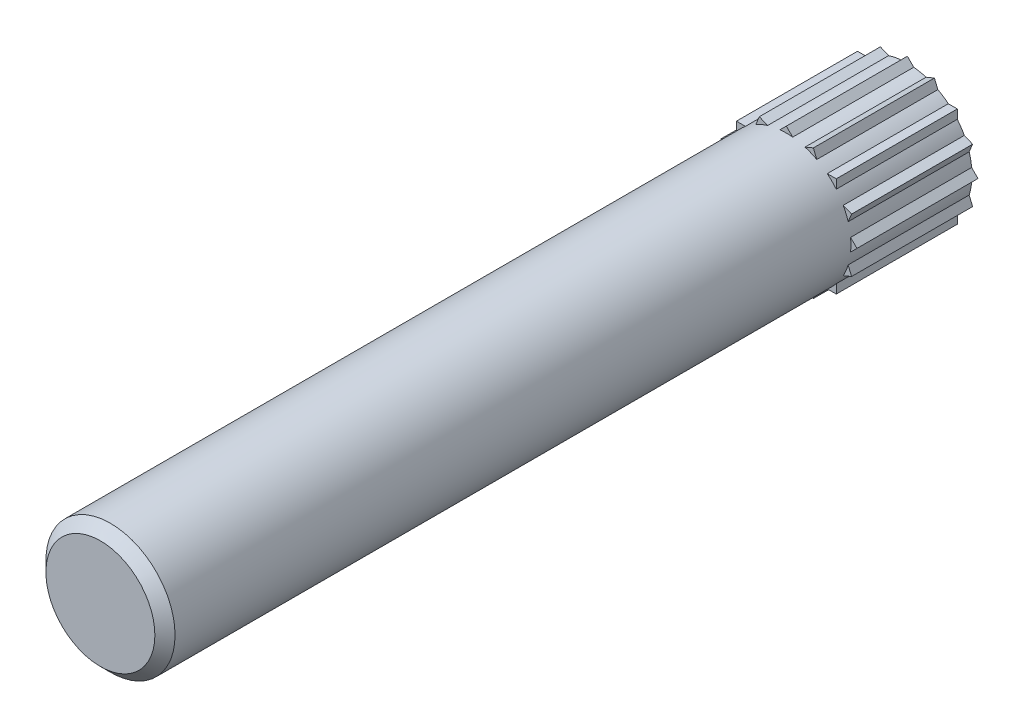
ISO-10303-21;
HEADER;
FILE_DESCRIPTION(('STEP AP214'),'2;1');
FILE_NAME('part.step','',(''),(''),'','','');
FILE_SCHEMA(('AUTOMOTIVE_DESIGN { 1 0 10303 214 1 1 1 1 }'));
ENDSEC;
DATA;
#1=APPLICATION_CONTEXT('core data for automotive mechanical design processes');
#2=APPLICATION_PROTOCOL_DEFINITION('international standard','automotive_design',2000,#1);
#3=PRODUCT_CONTEXT('',#1,'mechanical');
#4=PRODUCT('Part','Part','',(#3));
#5=PRODUCT_RELATED_PRODUCT_CATEGORY('part','',(#4));
#6=PRODUCT_DEFINITION_FORMATION('','',#4);
#7=PRODUCT_DEFINITION_CONTEXT('part definition',#1,'design');
#8=PRODUCT_DEFINITION('design','',#6,#7);
#9=PRODUCT_DEFINITION_SHAPE('','',#8);
#10=(LENGTH_UNIT() NAMED_UNIT(*) SI_UNIT(.MILLI.,.METRE.));
#11=(NAMED_UNIT(*) PLANE_ANGLE_UNIT() SI_UNIT($,.RADIAN.));
#12=(NAMED_UNIT(*) SI_UNIT($,.STERADIAN.) SOLID_ANGLE_UNIT());
#13=UNCERTAINTY_MEASURE_WITH_UNIT(LENGTH_MEASURE(1.E-05),#10,'distance_accuracy_value','');
#14=(GEOMETRIC_REPRESENTATION_CONTEXT(3) GLOBAL_UNCERTAINTY_ASSIGNED_CONTEXT((#13)) GLOBAL_UNIT_ASSIGNED_CONTEXT((#10,
#11,#12)) REPRESENTATION_CONTEXT('',''));
#15=CARTESIAN_POINT('',(0.,0.,0.));
#16=DIRECTION('',(0.,0.,1.));
#17=DIRECTION('',(1.,0.,0.));
#18=AXIS2_PLACEMENT_3D('',#15,#16,#17);
#19=CARTESIAN_POINT('',(-1.75,0.,3.));
#20=DIRECTION('',(-0.707106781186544,-0.707106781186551,0.));
#21=DIRECTION('',(0.707106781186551,-0.707106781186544,0.));
#22=AXIS2_PLACEMENT_3D('',#19,#20,#21);
#23=PLANE('',#22);
#24=DIRECTION('',(-0.707106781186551,0.707106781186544,0.));
#25=VECTOR('',#24,1.);
#26=CARTESIAN_POINT('',(-1.75,0.,0.));
#27=LINE('',#26,#25);
#28=CARTESIAN_POINT('',(-1.59219941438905,-0.157800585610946,0.));
#29=VERTEX_POINT('',#28);
#30=CARTESIAN_POINT('',(-1.75,0.,0.));
#31=VERTEX_POINT('',#30);
#32=EDGE_CURVE('E95',#29,#31,#27,.T.);
#33=ORIENTED_EDGE('',*,*,#32,.F.);
#34=DIRECTION('',(0.,0.,-1.));
#35=VECTOR('',#34,1.);
#36=CARTESIAN_POINT('',(-1.59219941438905,-0.157800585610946,3.));
#37=LINE('',#36,#35);
#38=CARTESIAN_POINT('',(-1.59219941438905,-0.157800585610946,3.));
#39=VERTEX_POINT('',#38);
#40=EDGE_CURVE('E12',#39,#29,#37,.T.);
#41=ORIENTED_EDGE('',*,*,#40,.F.);
#42=DIRECTION('',(-0.707106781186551,0.707106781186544,0.));
#43=VECTOR('',#42,1.);
#44=CARTESIAN_POINT('',(-1.75,0.,3.));
#45=LINE('',#44,#43);
#46=CARTESIAN_POINT('',(-1.75,0.,3.));
#47=VERTEX_POINT('',#46);
#48=EDGE_CURVE('E87',#39,#47,#45,.T.);
#49=ORIENTED_EDGE('',*,*,#48,.T.);
#50=DIRECTION('',(0.,0.,-1.));
#51=VECTOR('',#50,1.);
#52=CARTESIAN_POINT('',(-1.75,0.,3.));
#53=LINE('',#52,#51);
#54=EDGE_CURVE('E46',#47,#31,#53,.T.);
#55=ORIENTED_EDGE('',*,*,#54,.T.);
#56=EDGE_LOOP('',(#33,#41,#49,#55));
#57=FACE_BOUND('',#56,.T.);
#58=ADVANCED_FACE('F43',(#57),#23,.T.);
#59=CARTESIAN_POINT('',(0.,0.,3.));
#60=DIRECTION('',(0.,0.,-1.));
#61=DIRECTION('',(-1.,0.,0.));
#62=AXIS2_PLACEMENT_3D('',#59,#60,#61);
#63=CYLINDRICAL_SURFACE('',#62,1.6);
#64=CARTESIAN_POINT('',(0.,0.,0.));
#65=DIRECTION('',(0.,0.,1.));
#66=DIRECTION('',(-1.,0.,0.));
#67=AXIS2_PLACEMENT_3D('',#64,#65,#66);
#68=CIRCLE('',#67,1.6);
#69=CARTESIAN_POINT('',(-1.59219941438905,0.157800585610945,0.));
#70=VERTEX_POINT('',#69);
#71=EDGE_CURVE('E89',#70,#29,#68,.T.);
#72=ORIENTED_EDGE('',*,*,#71,.F.);
#73=DIRECTION('',(0.,0.,-1.));
#74=VECTOR('',#73,1.);
#75=CARTESIAN_POINT('',(-1.59219941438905,0.157800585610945,3.));
#76=LINE('',#75,#74);
#77=CARTESIAN_POINT('',(-1.59219941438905,0.157800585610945,3.));
#78=VERTEX_POINT('',#77);
#79=EDGE_CURVE('E52',#78,#70,#76,.T.);
#80=ORIENTED_EDGE('',*,*,#79,.F.);
#81=CARTESIAN_POINT('',(0.,0.,3.));
#82=DIRECTION('',(0.,0.,1.));
#83=DIRECTION('',(-1.,0.,0.));
#84=AXIS2_PLACEMENT_3D('',#81,#82,#83);
#85=CIRCLE('',#84,1.6);
#86=EDGE_CURVE('E84',#78,#39,#85,.T.);
#87=ORIENTED_EDGE('',*,*,#86,.T.);
#88=ORIENTED_EDGE('',*,*,#40,.T.);
#89=EDGE_LOOP('',(#72,#80,#87,#88));
#90=FACE_BOUND('',#89,.T.);
#91=ADVANCED_FACE('F99',(#90),#63,.F.);
#92=CARTESIAN_POINT('',(-1.75,0.,3.));
#93=DIRECTION('',(-0.707106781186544,0.707106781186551,0.));
#94=DIRECTION('',(-0.707106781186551,-0.707106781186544,0.));
#95=AXIS2_PLACEMENT_3D('',#92,#93,#94);
#96=PLANE('',#95);
#97=DIRECTION('',(0.707106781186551,0.707106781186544,0.));
#98=VECTOR('',#97,1.);
#99=CARTESIAN_POINT('',(-1.75,0.,0.));
#100=LINE('',#99,#98);
#101=EDGE_CURVE('E82',#31,#70,#100,.T.);
#102=ORIENTED_EDGE('',*,*,#101,.F.);
#103=ORIENTED_EDGE('',*,*,#54,.F.);
#104=DIRECTION('',(0.707106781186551,0.707106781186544,0.));
#105=VECTOR('',#104,1.);
#106=CARTESIAN_POINT('',(-1.75,0.,3.));
#107=LINE('',#106,#105);
#108=EDGE_CURVE('E80',#47,#78,#107,.T.);
#109=ORIENTED_EDGE('',*,*,#108,.T.);
#110=ORIENTED_EDGE('',*,*,#79,.T.);
#111=EDGE_LOOP('',(#102,#103,#109,#110));
#112=FACE_BOUND('',#111,.T.);
#113=ADVANCED_FACE('F79',(#112),#96,.T.);
#114=CARTESIAN_POINT('',(0.,0.,3.));
#115=DIRECTION('',(0.,0.,-1.));
#116=DIRECTION('',(-1.,0.,0.));
#117=AXIS2_PLACEMENT_3D('',#114,#115,#116);
#118=PLANE('',#117);
#119=ORIENTED_EDGE('',*,*,#48,.F.);
#120=ORIENTED_EDGE('',*,*,#86,.F.);
#121=ORIENTED_EDGE('',*,*,#108,.F.);
#122=EDGE_LOOP('',(#119,#120,#121));
#123=FACE_BOUND('',#122,.T.);
#124=ADVANCED_FACE('F86',(#123),#118,.F.);
#125=CARTESIAN_POINT('',(0.,0.,0.));
#126=DIRECTION('',(0.,0.,-1.));
#127=DIRECTION('',(-1.,0.,0.));
#128=AXIS2_PLACEMENT_3D('',#125,#126,#127);
#129=PLANE('',#128);
#130=ORIENTED_EDGE('',*,*,#32,.T.);
#131=ORIENTED_EDGE('',*,*,#101,.T.);
#132=ORIENTED_EDGE('',*,*,#71,.T.);
#133=EDGE_LOOP('',(#130,#131,#132));
#134=FACE_BOUND('',#133,.T.);
#135=ADVANCED_FACE('F98',(#134),#129,.T.);
#136=CLOSED_SHELL('',(#58,#91,#113,#124,#135));
#137=MANIFOLD_SOLID_BREP('B2',#136);
#138=CARTESIAN_POINT('',(0.,0.,20.));
#139=DIRECTION('',(0.,0.,-1.));
#140=DIRECTION('',(-1.,0.,0.));
#141=AXIS2_PLACEMENT_3D('',#138,#139,#140);
#142=CYLINDRICAL_SURFACE('',#141,1.6);
#143=CARTESIAN_POINT('',(0.,0.,19.75));
#144=DIRECTION('',(0.,0.,1.));
#145=DIRECTION('',(1.,0.,0.));
#146=AXIS2_PLACEMENT_3D('',#143,#144,#145);
#147=CIRCLE('',#146,1.6);
#148=CARTESIAN_POINT('',(1.6,0.,19.75));
#149=VERTEX_POINT('',#148);
#150=EDGE_CURVE('E41',#149,#149,#147,.F.);
#151=ORIENTED_EDGE('',*,*,#150,.T.);
#152=EDGE_LOOP('',(#151));
#153=FACE_BOUND('',#152,.T.);
#154=CARTESIAN_POINT('',(0.,0.,3.));
#155=DIRECTION('',(0.,0.,1.));
#156=DIRECTION('',(-0.923879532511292,-0.382683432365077,0.));
#157=AXIS2_PLACEMENT_3D('',#154,#155,#156);
#158=CIRCLE('',#157,1.6);
#159=CARTESIAN_POINT('',(-1.53138812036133,-0.46351960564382,3.));
#160=VERTEX_POINT('',#159);
#161=CARTESIAN_POINT('',(-1.4106127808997,-0.755097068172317,3.));
#162=VERTEX_POINT('',#161);
#163=EDGE_CURVE('E160',#160,#162,#158,.T.);
#164=ORIENTED_EDGE('',*,*,#163,.T.);
#165=DIRECTION('',(0.,0.,-1.));
#166=VECTOR('',#165,1.);
#167=CARTESIAN_POINT('',(-1.41061278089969,-0.755097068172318,3.));
#168=LINE('',#167,#166);
#169=CARTESIAN_POINT('',(-1.41061278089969,-0.755097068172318,0.));
#170=VERTEX_POINT('',#169);
#171=EDGE_CURVE('E438',#162,#170,#168,.T.);
#172=ORIENTED_EDGE('',*,*,#171,.T.);
#173=CARTESIAN_POINT('',(0.,0.,0.));
#174=DIRECTION('',(0.,0.,1.));
#175=DIRECTION('',(1.,0.,0.));
#176=AXIS2_PLACEMENT_3D('',#173,#174,#175);
#177=CIRCLE('',#176,1.6);
#178=CARTESIAN_POINT('',(-1.23743686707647,-1.01427313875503,0.));
#179=VERTEX_POINT('',#178);
#180=EDGE_CURVE('E426',#170,#179,#177,.T.);
#181=ORIENTED_EDGE('',*,*,#180,.T.);
#182=DIRECTION('',(0.,0.,-1.));
#183=VECTOR('',#182,1.);
#184=CARTESIAN_POINT('',(-1.23743686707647,-1.01427313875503,3.));
#185=LINE('',#184,#183);
#186=CARTESIAN_POINT('',(-1.23743686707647,-1.01427313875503,3.));
#187=VERTEX_POINT('',#186);
#188=EDGE_CURVE('E468',#187,#179,#185,.T.);
#189=ORIENTED_EDGE('',*,*,#188,.F.);
#190=CARTESIAN_POINT('',(0.,0.,3.));
#191=DIRECTION('',(0.,0.,1.));
#192=DIRECTION('',(-0.707106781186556,-0.707106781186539,0.));
#193=AXIS2_PLACEMENT_3D('',#190,#191,#192);
#194=CIRCLE('',#193,1.6);
#195=CARTESIAN_POINT('',(-1.01427313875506,-1.23743686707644,3.));
#196=VERTEX_POINT('',#195);
#197=EDGE_CURVE('E470',#187,#196,#194,.T.);
#198=ORIENTED_EDGE('',*,*,#197,.T.);
#199=DIRECTION('',(0.,0.,-1.));
#200=VECTOR('',#199,1.);
#201=CARTESIAN_POINT('',(-1.01427313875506,-1.23743686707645,3.));
#202=LINE('',#201,#200);
#203=CARTESIAN_POINT('',(-1.01427313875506,-1.23743686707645,0.));
#204=VERTEX_POINT('',#203);
#205=EDGE_CURVE('E460',#196,#204,#202,.T.);
#206=ORIENTED_EDGE('',*,*,#205,.T.);
#207=CARTESIAN_POINT('',(-0.755097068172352,-1.41061278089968,0.));
#208=VERTEX_POINT('',#207);
#209=EDGE_CURVE('E436',#204,#208,#177,.T.);
#210=ORIENTED_EDGE('',*,*,#209,.T.);
#211=DIRECTION('',(0.,0.,-1.));
#212=VECTOR('',#211,1.);
#213=CARTESIAN_POINT('',(-0.755097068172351,-1.41061278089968,3.));
#214=LINE('',#213,#212);
#215=CARTESIAN_POINT('',(-0.755097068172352,-1.41061278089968,3.));
#216=VERTEX_POINT('',#215);
#217=EDGE_CURVE('E486',#216,#208,#214,.T.);
#218=ORIENTED_EDGE('',*,*,#217,.F.);
#219=CARTESIAN_POINT('',(0.,0.,3.));
#220=DIRECTION('',(0.,0.,1.));
#221=DIRECTION('',(-0.3826834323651,-0.923879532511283,0.));
#222=AXIS2_PLACEMENT_3D('',#219,#220,#221);
#223=CIRCLE('',#222,1.6);
#224=CARTESIAN_POINT('',(-0.463519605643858,-1.53138812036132,3.));
#225=VERTEX_POINT('',#224);
#226=EDGE_CURVE('E489',#216,#225,#223,.T.);
#227=ORIENTED_EDGE('',*,*,#226,.T.);
#228=DIRECTION('',(0.,0.,-1.));
#229=VECTOR('',#228,1.);
#230=CARTESIAN_POINT('',(-0.463519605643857,-1.53138812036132,3.));
#231=LINE('',#230,#229);
#232=CARTESIAN_POINT('',(-0.463519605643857,-1.53138812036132,0.));
#233=VERTEX_POINT('',#232);
#234=EDGE_CURVE('E478',#225,#233,#231,.T.);
#235=ORIENTED_EDGE('',*,*,#234,.T.);
#236=CARTESIAN_POINT('',(-0.157800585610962,-1.59219941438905,0.));
#237=VERTEX_POINT('',#236);
#238=EDGE_CURVE('E1327',#233,#237,#177,.T.);
#239=ORIENTED_EDGE('',*,*,#238,.T.);
#240=DIRECTION('',(0.,0.,-1.));
#241=VECTOR('',#240,1.);
#242=CARTESIAN_POINT('',(-0.157800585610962,-1.59219941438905,3.));
#243=LINE('',#242,#241);
#244=CARTESIAN_POINT('',(-0.157800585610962,-1.59219941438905,3.));
#245=VERTEX_POINT('',#244);
#246=EDGE_CURVE('E507',#245,#237,#243,.T.);
#247=ORIENTED_EDGE('',*,*,#246,.F.);
#248=CARTESIAN_POINT('',(0.,0.,3.));
#249=DIRECTION('',(0.,0.,1.));
#250=DIRECTION('',(0.,-1.,0.));
#251=AXIS2_PLACEMENT_3D('',#248,#249,#250);
#252=CIRCLE('',#251,1.6);
#253=CARTESIAN_POINT('',(0.157800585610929,-1.59219941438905,3.));
#254=VERTEX_POINT('',#253);
#255=EDGE_CURVE('E510',#245,#254,#252,.T.);
#256=ORIENTED_EDGE('',*,*,#255,.T.);
#257=DIRECTION('',(0.,0.,-1.));
#258=VECTOR('',#257,1.);
#259=CARTESIAN_POINT('',(0.15780058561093,-1.59219941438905,3.));
#260=LINE('',#259,#258);
#261=CARTESIAN_POINT('',(0.15780058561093,-1.59219941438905,0.));
#262=VERTEX_POINT('',#261);
#263=EDGE_CURVE('E499',#254,#262,#260,.T.);
#264=ORIENTED_EDGE('',*,*,#263,.T.);
#265=CARTESIAN_POINT('',(0.463519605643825,-1.53138812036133,0.));
#266=VERTEX_POINT('',#265);
#267=EDGE_CURVE('E1319',#262,#266,#177,.T.);
#268=ORIENTED_EDGE('',*,*,#267,.T.);
#269=DIRECTION('',(0.,0.,-1.));
#270=VECTOR('',#269,1.);
#271=CARTESIAN_POINT('',(0.463519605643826,-1.53138812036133,3.));
#272=LINE('',#271,#270);
#273=CARTESIAN_POINT('',(0.463519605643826,-1.53138812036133,3.));
#274=VERTEX_POINT('',#273);
#275=EDGE_CURVE('E528',#274,#266,#272,.T.);
#276=ORIENTED_EDGE('',*,*,#275,.F.);
#277=CARTESIAN_POINT('',(0.,0.,3.));
#278=DIRECTION('',(0.,0.,1.));
#279=DIRECTION('',(0.382683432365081,-0.923879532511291,0.));
#280=AXIS2_PLACEMENT_3D('',#277,#278,#279);
#281=CIRCLE('',#280,1.6);
#282=CARTESIAN_POINT('',(0.755097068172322,-1.41061278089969,3.));
#283=VERTEX_POINT('',#282);
#284=EDGE_CURVE('E531',#274,#283,#281,.T.);
#285=ORIENTED_EDGE('',*,*,#284,.T.);
#286=DIRECTION('',(0.,0.,-1.));
#287=VECTOR('',#286,1.);
#288=CARTESIAN_POINT('',(0.755097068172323,-1.41061278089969,3.));
#289=LINE('',#288,#287);
#290=CARTESIAN_POINT('',(0.755097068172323,-1.41061278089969,0.));
#291=VERTEX_POINT('',#290);
#292=EDGE_CURVE('E520',#283,#291,#289,.T.);
#293=ORIENTED_EDGE('',*,*,#292,.T.);
#294=CARTESIAN_POINT('',(1.01427313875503,-1.23743686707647,0.));
#295=VERTEX_POINT('',#294);
#296=EDGE_CURVE('E1311',#291,#295,#177,.T.);
#297=ORIENTED_EDGE('',*,*,#296,.T.);
#298=DIRECTION('',(0.,0.,-1.));
#299=VECTOR('',#298,1.);
#300=CARTESIAN_POINT('',(1.01427313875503,-1.23743686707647,3.));
#301=LINE('',#300,#299);
#302=CARTESIAN_POINT('',(1.01427313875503,-1.23743686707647,3.));
#303=VERTEX_POINT('',#302);
#304=EDGE_CURVE('E549',#303,#295,#301,.T.);
#305=ORIENTED_EDGE('',*,*,#304,.F.);
#306=CARTESIAN_POINT('',(0.,0.,3.));
#307=DIRECTION('',(0.,0.,1.));
#308=DIRECTION('',(0.707106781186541,-0.707106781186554,0.));
#309=AXIS2_PLACEMENT_3D('',#306,#307,#308);
#310=CIRCLE('',#309,1.6);
#311=CARTESIAN_POINT('',(1.23743686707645,-1.01427313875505,3.));
#312=VERTEX_POINT('',#311);
#313=EDGE_CURVE('E552',#303,#312,#310,.T.);
#314=ORIENTED_EDGE('',*,*,#313,.T.);
#315=DIRECTION('',(0.,0.,-1.));
#316=VECTOR('',#315,1.);
#317=CARTESIAN_POINT('',(1.23743686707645,-1.01427313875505,3.));
#318=LINE('',#317,#316);
#319=CARTESIAN_POINT('',(1.23743686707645,-1.01427313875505,0.));
#320=VERTEX_POINT('',#319);
#321=EDGE_CURVE('E541',#312,#320,#318,.T.);
#322=ORIENTED_EDGE('',*,*,#321,.T.);
#323=CARTESIAN_POINT('',(1.41061278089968,-0.755097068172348,0.));
#324=VERTEX_POINT('',#323);
#325=EDGE_CURVE('E1303',#320,#324,#177,.T.);
#326=ORIENTED_EDGE('',*,*,#325,.T.);
#327=DIRECTION('',(0.,0.,-1.));
#328=VECTOR('',#327,1.);
#329=CARTESIAN_POINT('',(1.41061278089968,-0.755097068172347,3.));
#330=LINE('',#329,#328);
#331=CARTESIAN_POINT('',(1.41061278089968,-0.755097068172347,3.));
#332=VERTEX_POINT('',#331);
#333=EDGE_CURVE('E570',#332,#324,#330,.T.);
#334=ORIENTED_EDGE('',*,*,#333,.F.);
#335=CARTESIAN_POINT('',(0.,0.,3.));
#336=DIRECTION('',(0.,0.,1.));
#337=DIRECTION('',(0.923879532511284,-0.382683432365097,0.));
#338=AXIS2_PLACEMENT_3D('',#335,#336,#337);
#339=CIRCLE('',#338,1.6);
#340=CARTESIAN_POINT('',(1.53138812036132,-0.463519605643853,3.));
#341=VERTEX_POINT('',#340);
#342=EDGE_CURVE('E573',#332,#341,#339,.T.);
#343=ORIENTED_EDGE('',*,*,#342,.T.);
#344=DIRECTION('',(0.,0.,-1.));
#345=VECTOR('',#344,1.);
#346=CARTESIAN_POINT('',(1.53138812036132,-0.463519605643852,3.));
#347=LINE('',#346,#345);
#348=CARTESIAN_POINT('',(1.53138812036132,-0.463519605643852,0.));
#349=VERTEX_POINT('',#348);
#350=EDGE_CURVE('E562',#341,#349,#347,.T.);
#351=ORIENTED_EDGE('',*,*,#350,.T.);
#352=CARTESIAN_POINT('',(1.59219941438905,-0.157800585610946,0.));
#353=VERTEX_POINT('',#352);
#354=EDGE_CURVE('E1295',#349,#353,#177,.T.);
#355=ORIENTED_EDGE('',*,*,#354,.T.);
#356=DIRECTION('',(0.,0.,-1.));
#357=VECTOR('',#356,1.);
#358=CARTESIAN_POINT('',(1.59219941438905,-0.157800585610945,3.));
#359=LINE('',#358,#357);
#360=CARTESIAN_POINT('',(1.59219941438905,-0.157800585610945,3.));
#361=VERTEX_POINT('',#360);
#362=EDGE_CURVE('E591',#361,#353,#359,.T.);
#363=ORIENTED_EDGE('',*,*,#362,.F.);
#364=CARTESIAN_POINT('',(0.,0.,3.));
#365=DIRECTION('',(0.,0.,1.));
#366=DIRECTION('',(1.,0.,0.));
#367=AXIS2_PLACEMENT_3D('',#364,#365,#366);
#368=CIRCLE('',#367,1.6);
#369=CARTESIAN_POINT('',(1.59219941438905,0.157800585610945,3.));
#370=VERTEX_POINT('',#369);
#371=EDGE_CURVE('E594',#361,#370,#368,.T.);
#372=ORIENTED_EDGE('',*,*,#371,.T.);
#373=DIRECTION('',(0.,0.,-1.));
#374=VECTOR('',#373,1.);
#375=CARTESIAN_POINT('',(1.59219941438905,0.157800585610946,3.));
#376=LINE('',#375,#374);
#377=CARTESIAN_POINT('',(1.59219941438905,0.157800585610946,0.));
#378=VERTEX_POINT('',#377);
#379=EDGE_CURVE('E583',#370,#378,#376,.T.);
#380=ORIENTED_EDGE('',*,*,#379,.T.);
#381=CARTESIAN_POINT('',(1.53138812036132,0.463519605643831,0.));
#382=VERTEX_POINT('',#381);
#383=EDGE_CURVE('E1287',#378,#382,#177,.T.);
#384=ORIENTED_EDGE('',*,*,#383,.T.);
#385=DIRECTION('',(0.,0.,-1.));
#386=VECTOR('',#385,1.);
#387=CARTESIAN_POINT('',(1.53138812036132,0.463519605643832,3.));
#388=LINE('',#387,#386);
#389=CARTESIAN_POINT('',(1.53138812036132,0.463519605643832,3.));
#390=VERTEX_POINT('',#389);
#391=EDGE_CURVE('E612',#390,#382,#388,.T.);
#392=ORIENTED_EDGE('',*,*,#391,.F.);
#393=CARTESIAN_POINT('',(0.,0.,3.));
#394=DIRECTION('',(0.,0.,1.));
#395=DIRECTION('',(0.923879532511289,0.382683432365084,0.));
#396=AXIS2_PLACEMENT_3D('',#393,#394,#395);
#397=CIRCLE('',#396,1.6);
#398=CARTESIAN_POINT('',(1.41061278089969,0.755097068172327,3.));
#399=VERTEX_POINT('',#398);
#400=EDGE_CURVE('E615',#390,#399,#397,.T.);
#401=ORIENTED_EDGE('',*,*,#400,.T.);
#402=DIRECTION('',(0.,0.,-1.));
#403=VECTOR('',#402,1.);
#404=CARTESIAN_POINT('',(1.41061278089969,0.755097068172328,3.));
#405=LINE('',#404,#403);
#406=CARTESIAN_POINT('',(1.41061278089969,0.755097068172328,0.));
#407=VERTEX_POINT('',#406);
#408=EDGE_CURVE('E604',#399,#407,#405,.T.);
#409=ORIENTED_EDGE('',*,*,#408,.T.);
#410=CARTESIAN_POINT('',(1.23743686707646,1.01427313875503,0.));
#411=VERTEX_POINT('',#410);
#412=EDGE_CURVE('E1279',#407,#411,#177,.T.);
#413=ORIENTED_EDGE('',*,*,#412,.T.);
#414=DIRECTION('',(0.,0.,-1.));
#415=VECTOR('',#414,1.);
#416=CARTESIAN_POINT('',(1.23743686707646,1.01427313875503,3.));
#417=LINE('',#416,#415);
#418=CARTESIAN_POINT('',(1.23743686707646,1.01427313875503,3.));
#419=VERTEX_POINT('',#418);
#420=EDGE_CURVE('E633',#419,#411,#417,.T.);
#421=ORIENTED_EDGE('',*,*,#420,.F.);
#422=CARTESIAN_POINT('',(0.,0.,3.));
#423=DIRECTION('',(0.,0.,1.));
#424=DIRECTION('',(0.707106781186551,0.707106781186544,0.));
#425=AXIS2_PLACEMENT_3D('',#422,#423,#424);
#426=CIRCLE('',#425,1.6);
#427=CARTESIAN_POINT('',(1.01427313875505,1.23743686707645,3.));
#428=VERTEX_POINT('',#427);
#429=EDGE_CURVE('E636',#419,#428,#426,.T.);
#430=ORIENTED_EDGE('',*,*,#429,.T.);
#431=DIRECTION('',(0.,0.,-1.));
#432=VECTOR('',#431,1.);
#433=CARTESIAN_POINT('',(1.01427313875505,1.23743686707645,3.));
#434=LINE('',#433,#432);
#435=CARTESIAN_POINT('',(1.01427313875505,1.23743686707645,0.));
#436=VERTEX_POINT('',#435);
#437=EDGE_CURVE('E625',#428,#436,#434,.T.);
#438=ORIENTED_EDGE('',*,*,#437,.T.);
#439=CARTESIAN_POINT('',(0.755097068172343,1.41061278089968,0.));
#440=VERTEX_POINT('',#439);
#441=EDGE_CURVE('E1271',#436,#440,#177,.T.);
#442=ORIENTED_EDGE('',*,*,#441,.T.);
#443=DIRECTION('',(0.,0.,-1.));
#444=VECTOR('',#443,1.);
#445=CARTESIAN_POINT('',(0.755097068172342,1.41061278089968,3.));
#446=LINE('',#445,#444);
#447=CARTESIAN_POINT('',(0.755097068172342,1.41061278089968,3.));
#448=VERTEX_POINT('',#447);
#449=EDGE_CURVE('E654',#448,#440,#446,.T.);
#450=ORIENTED_EDGE('',*,*,#449,.F.);
#451=CARTESIAN_POINT('',(0.,0.,3.));
#452=DIRECTION('',(0.,0.,1.));
#453=DIRECTION('',(0.382683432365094,0.923879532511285,0.));
#454=AXIS2_PLACEMENT_3D('',#451,#452,#453);
#455=CIRCLE('',#454,1.6);
#456=CARTESIAN_POINT('',(0.463519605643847,1.53138812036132,3.));
#457=VERTEX_POINT('',#456);
#458=EDGE_CURVE('E657',#448,#457,#455,.T.);
#459=ORIENTED_EDGE('',*,*,#458,.T.);
#460=DIRECTION('',(0.,0.,-1.));
#461=VECTOR('',#460,1.);
#462=CARTESIAN_POINT('',(0.463519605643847,1.53138812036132,3.));
#463=LINE('',#462,#461);
#464=CARTESIAN_POINT('',(0.463519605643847,1.53138812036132,0.));
#465=VERTEX_POINT('',#464);
#466=EDGE_CURVE('E646',#457,#465,#463,.T.);
#467=ORIENTED_EDGE('',*,*,#466,.T.);
#468=CARTESIAN_POINT('',(0.157800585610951,1.59219941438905,0.));
#469=VERTEX_POINT('',#468);
#470=EDGE_CURVE('E1263',#465,#469,#177,.T.);
#471=ORIENTED_EDGE('',*,*,#470,.T.);
#472=DIRECTION('',(0.,0.,-1.));
#473=VECTOR('',#472,1.);
#474=CARTESIAN_POINT('',(0.157800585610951,1.59219941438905,3.));
#475=LINE('',#474,#473);
#476=CARTESIAN_POINT('',(0.157800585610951,1.59219941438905,3.));
#477=VERTEX_POINT('',#476);
#478=EDGE_CURVE('E675',#477,#469,#475,.T.);
#479=ORIENTED_EDGE('',*,*,#478,.F.);
#480=CARTESIAN_POINT('',(0.,0.,3.));
#481=DIRECTION('',(0.,0.,1.));
#482=DIRECTION('',(0.,1.,0.));
#483=AXIS2_PLACEMENT_3D('',#480,#481,#482);
#484=CIRCLE('',#483,1.6);
#485=CARTESIAN_POINT('',(-0.15780058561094,1.59219941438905,3.));
#486=VERTEX_POINT('',#485);
#487=EDGE_CURVE('E678',#477,#486,#484,.T.);
#488=ORIENTED_EDGE('',*,*,#487,.T.);
#489=DIRECTION('',(0.,0.,-1.));
#490=VECTOR('',#489,1.);
#491=CARTESIAN_POINT('',(-0.157800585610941,1.59219941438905,3.));
#492=LINE('',#491,#490);
#493=CARTESIAN_POINT('',(-0.157800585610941,1.59219941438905,0.));
#494=VERTEX_POINT('',#493);
#495=EDGE_CURVE('E667',#486,#494,#492,.T.);
#496=ORIENTED_EDGE('',*,*,#495,.T.);
#497=CARTESIAN_POINT('',(-0.463519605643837,1.53138812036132,0.));
#498=VERTEX_POINT('',#497);
#499=EDGE_CURVE('E1255',#494,#498,#177,.T.);
#500=ORIENTED_EDGE('',*,*,#499,.T.);
#501=DIRECTION('',(0.,0.,-1.));
#502=VECTOR('',#501,1.);
#503=CARTESIAN_POINT('',(-0.463519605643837,1.53138812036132,3.));
#504=LINE('',#503,#502);
#505=CARTESIAN_POINT('',(-0.463519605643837,1.53138812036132,3.));
#506=VERTEX_POINT('',#505);
#507=EDGE_CURVE('E696',#506,#498,#504,.T.);
#508=ORIENTED_EDGE('',*,*,#507,.F.);
#509=CARTESIAN_POINT('',(0.,0.,3.));
#510=DIRECTION('',(0.,0.,1.));
#511=DIRECTION('',(-0.382683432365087,0.923879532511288,0.));
#512=AXIS2_PLACEMENT_3D('',#509,#510,#511);
#513=CIRCLE('',#512,1.6);
#514=CARTESIAN_POINT('',(-0.755097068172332,1.41061278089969,3.));
#515=VERTEX_POINT('',#514);
#516=EDGE_CURVE('E699',#506,#515,#513,.T.);
#517=ORIENTED_EDGE('',*,*,#516,.T.);
#518=DIRECTION('',(0.,0.,-1.));
#519=VECTOR('',#518,1.);
#520=CARTESIAN_POINT('',(-0.755097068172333,1.41061278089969,3.));
#521=LINE('',#520,#519);
#522=CARTESIAN_POINT('',(-0.755097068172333,1.41061278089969,0.));
#523=VERTEX_POINT('',#522);
#524=EDGE_CURVE('E688',#515,#523,#521,.T.);
#525=ORIENTED_EDGE('',*,*,#524,.T.);
#526=CARTESIAN_POINT('',(-1.01427313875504,1.23743686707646,0.));
#527=VERTEX_POINT('',#526);
#528=EDGE_CURVE('E1247',#523,#527,#177,.T.);
#529=ORIENTED_EDGE('',*,*,#528,.T.);
#530=DIRECTION('',(0.,0.,-1.));
#531=VECTOR('',#530,1.);
#532=CARTESIAN_POINT('',(-1.01427313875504,1.23743686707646,3.));
#533=LINE('',#532,#531);
#534=CARTESIAN_POINT('',(-1.01427313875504,1.23743686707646,3.));
#535=VERTEX_POINT('',#534);
#536=EDGE_CURVE('E717',#535,#527,#533,.T.);
#537=ORIENTED_EDGE('',*,*,#536,.F.);
#538=CARTESIAN_POINT('',(0.,0.,3.));
#539=DIRECTION('',(0.,0.,1.));
#540=DIRECTION('',(-0.707106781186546,0.707106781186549,0.));
#541=AXIS2_PLACEMENT_3D('',#538,#539,#540);
#542=CIRCLE('',#541,1.6);
#543=CARTESIAN_POINT('',(-1.23743686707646,1.01427313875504,3.));
#544=VERTEX_POINT('',#543);
#545=EDGE_CURVE('E720',#535,#544,#542,.T.);
#546=ORIENTED_EDGE('',*,*,#545,.T.);
#547=DIRECTION('',(0.,0.,-1.));
#548=VECTOR('',#547,1.);
#549=CARTESIAN_POINT('',(-1.23743686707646,1.01427313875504,3.));
#550=LINE('',#549,#548);
#551=CARTESIAN_POINT('',(-1.23743686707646,1.01427313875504,0.));
#552=VERTEX_POINT('',#551);
#553=EDGE_CURVE('E709',#544,#552,#550,.T.);
#554=ORIENTED_EDGE('',*,*,#553,.T.);
#555=CARTESIAN_POINT('',(-1.41061278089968,0.755097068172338,0.));
#556=VERTEX_POINT('',#555);
#557=EDGE_CURVE('E748',#552,#556,#177,.T.);
#558=ORIENTED_EDGE('',*,*,#557,.T.);
#559=DIRECTION('',(0.,0.,-1.));
#560=VECTOR('',#559,1.);
#561=CARTESIAN_POINT('',(-1.41061278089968,0.755097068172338,3.));
#562=LINE('',#561,#560);
#563=CARTESIAN_POINT('',(-1.41061278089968,0.755097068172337,3.));
#564=VERTEX_POINT('',#563);
#565=EDGE_CURVE('E738',#564,#556,#562,.T.);
#566=ORIENTED_EDGE('',*,*,#565,.F.);
#567=CARTESIAN_POINT('',(0.,0.,3.));
#568=DIRECTION('',(0.,0.,1.));
#569=DIRECTION('',(-0.923879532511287,0.382683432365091,0.));
#570=AXIS2_PLACEMENT_3D('',#567,#568,#569);
#571=CIRCLE('',#570,1.6);
#572=CARTESIAN_POINT('',(-1.53138812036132,0.463519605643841,3.));
#573=VERTEX_POINT('',#572);
#574=EDGE_CURVE('E741',#564,#573,#571,.T.);
#575=ORIENTED_EDGE('',*,*,#574,.T.);
#576=DIRECTION('',(0.,0.,-1.));
#577=VECTOR('',#576,1.);
#578=CARTESIAN_POINT('',(-1.53138812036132,0.463519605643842,3.));
#579=LINE('',#578,#577);
#580=CARTESIAN_POINT('',(-1.53138812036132,0.463519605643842,0.));
#581=VERTEX_POINT('',#580);
#582=EDGE_CURVE('E730',#573,#581,#579,.T.);
#583=ORIENTED_EDGE('',*,*,#582,.T.);
#584=CARTESIAN_POINT('',(-1.53138812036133,-0.46351960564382,0.));
#585=VERTEX_POINT('',#584);
#586=EDGE_CURVE('E435',#581,#585,#177,.T.);
#587=ORIENTED_EDGE('',*,*,#586,.T.);
#588=DIRECTION('',(0.,0.,-1.));
#589=VECTOR('',#588,1.);
#590=CARTESIAN_POINT('',(-1.53138812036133,-0.46351960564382,3.));
#591=LINE('',#590,#589);
#592=EDGE_CURVE('E156',#160,#585,#591,.T.);
#593=ORIENTED_EDGE('',*,*,#592,.F.);
#594=EDGE_LOOP('',(#164,#172,#181,#189,#198,#206,#210,#218,#227,#235,#239,#247,#256,#264,#268,
#276,#285,#293,#297,#305,#314,#322,#326,#334,#343,#351,#355,#363,#372,#380,#384,#392,#401,#409,
#413,#421,#430,#438,#442,#450,#459,#467,#471,#479,#488,#496,#500,#508,#517,#525,#529,#537,#546,
#554,#558,#566,#575,#583,#587,#593));
#595=FACE_BOUND('',#594,.T.);
#596=ADVANCED_FACE('F141',(#153,#595),#142,.T.);
#597=CARTESIAN_POINT('',(0.,0.,20.));
#598=DIRECTION('',(0.,0.,1.));
#599=DIRECTION('',(1.,0.,0.));
#600=AXIS2_PLACEMENT_3D('',#597,#598,#599);
#601=PLANE('',#600);
#602=CARTESIAN_POINT('',(0.,0.,20.));
#603=DIRECTION('',(0.,0.,1.));
#604=DIRECTION('',(1.,0.,0.));
#605=AXIS2_PLACEMENT_3D('',#602,#603,#604);
#606=CIRCLE('',#605,1.35000000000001);
#607=CARTESIAN_POINT('',(1.35000000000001,0.,20.));
#608=VERTEX_POINT('',#607);
#609=EDGE_CURVE('E149',#608,#608,#606,.T.);
#610=ORIENTED_EDGE('',*,*,#609,.T.);
#611=EDGE_LOOP('',(#610));
#612=FACE_BOUND('',#611,.T.);
#613=ADVANCED_FACE('F752',(#612),#601,.T.);
#614=CARTESIAN_POINT('',(0.,0.,0.));
#615=DIRECTION('',(0.,0.,1.));
#616=DIRECTION('',(1.,0.,0.));
#617=AXIS2_PLACEMENT_3D('',#614,#615,#616);
#618=PLANE('',#617);
#619=ORIENTED_EDGE('',*,*,#586,.F.);
#620=DIRECTION('',(-0.382683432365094,0.923879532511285,0.));
#621=VECTOR('',#620,1.);
#622=CARTESIAN_POINT('',(-1.61678918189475,0.669696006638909,0.));
#623=LINE('',#622,#621);
#624=CARTESIAN_POINT('',(-1.61678918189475,0.669696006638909,0.));
#625=VERTEX_POINT('',#624);
#626=EDGE_CURVE('E728',#581,#625,#623,.T.);
#627=ORIENTED_EDGE('',*,*,#626,.T.);
#628=DIRECTION('',(0.923879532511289,0.382683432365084,0.));
#629=VECTOR('',#628,1.);
#630=CARTESIAN_POINT('',(-1.61678918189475,0.669696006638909,0.));
#631=LINE('',#630,#629);
#632=EDGE_CURVE('E743',#625,#556,#631,.T.);
#633=ORIENTED_EDGE('',*,*,#632,.T.);
#634=ORIENTED_EDGE('',*,*,#557,.F.);
#635=DIRECTION('',(0.,1.,0.));
#636=VECTOR('',#635,1.);
#637=CARTESIAN_POINT('',(-1.23743686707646,1.23743686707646,0.));
#638=LINE('',#637,#636);
#639=CARTESIAN_POINT('',(-1.23743686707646,1.23743686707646,0.));
#640=VERTEX_POINT('',#639);
#641=EDGE_CURVE('E707',#552,#640,#638,.T.);
#642=ORIENTED_EDGE('',*,*,#641,.T.);
#643=DIRECTION('',(1.,0.,0.));
#644=VECTOR('',#643,1.);
#645=CARTESIAN_POINT('',(-1.23743686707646,1.23743686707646,0.));
#646=LINE('',#645,#644);
#647=EDGE_CURVE('E722',#640,#527,#646,.T.);
#648=ORIENTED_EDGE('',*,*,#647,.T.);
#649=ORIENTED_EDGE('',*,*,#528,.F.);
#650=DIRECTION('',(0.382683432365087,0.923879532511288,0.));
#651=VECTOR('',#650,1.);
#652=CARTESIAN_POINT('',(-0.669696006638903,1.61678918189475,0.));
#653=LINE('',#652,#651);
#654=CARTESIAN_POINT('',(-0.669696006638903,1.61678918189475,0.));
#655=VERTEX_POINT('',#654);
#656=EDGE_CURVE('E686',#523,#655,#653,.T.);
#657=ORIENTED_EDGE('',*,*,#656,.T.);
#658=DIRECTION('',(0.923879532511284,-0.382683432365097,0.));
#659=VECTOR('',#658,1.);
#660=CARTESIAN_POINT('',(-0.669696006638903,1.61678918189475,0.));
#661=LINE('',#660,#659);
#662=EDGE_CURVE('E701',#655,#498,#661,.T.);
#663=ORIENTED_EDGE('',*,*,#662,.T.);
#664=ORIENTED_EDGE('',*,*,#499,.F.);
#665=DIRECTION('',(0.707106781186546,0.707106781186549,0.));
#666=VECTOR('',#665,1.);
#667=CARTESIAN_POINT('',(0.,1.75,0.));
#668=LINE('',#667,#666);
#669=CARTESIAN_POINT('',(0.,1.75,0.));
#670=VERTEX_POINT('',#669);
#671=EDGE_CURVE('E665',#494,#670,#668,.T.);
#672=ORIENTED_EDGE('',*,*,#671,.T.);
#673=DIRECTION('',(0.707106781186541,-0.707106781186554,0.));
#674=VECTOR('',#673,1.);
#675=CARTESIAN_POINT('',(0.,1.75,0.));
#676=LINE('',#675,#674);
#677=EDGE_CURVE('E680',#670,#469,#676,.T.);
#678=ORIENTED_EDGE('',*,*,#677,.T.);
#679=ORIENTED_EDGE('',*,*,#470,.F.);
#680=DIRECTION('',(0.923879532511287,0.382683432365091,0.));
#681=VECTOR('',#680,1.);
#682=CARTESIAN_POINT('',(0.669696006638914,1.61678918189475,0.));
#683=LINE('',#682,#681);
#684=CARTESIAN_POINT('',(0.669696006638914,1.61678918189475,0.));
#685=VERTEX_POINT('',#684);
#686=EDGE_CURVE('E644',#465,#685,#683,.T.);
#687=ORIENTED_EDGE('',*,*,#686,.T.);
#688=DIRECTION('',(0.382683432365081,-0.923879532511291,0.));
#689=VECTOR('',#688,1.);
#690=CARTESIAN_POINT('',(0.669696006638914,1.61678918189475,0.));
#691=LINE('',#690,#689);
#692=EDGE_CURVE('E659',#685,#440,#691,.T.);
#693=ORIENTED_EDGE('',*,*,#692,.T.);
#694=ORIENTED_EDGE('',*,*,#441,.F.);
#695=DIRECTION('',(1.,0.,0.));
#696=VECTOR('',#695,1.);
#697=CARTESIAN_POINT('',(1.23743686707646,1.23743686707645,0.));
#698=LINE('',#697,#696);
#699=CARTESIAN_POINT('',(1.23743686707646,1.23743686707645,0.));
#700=VERTEX_POINT('',#699);
#701=EDGE_CURVE('E623',#436,#700,#698,.T.);
#702=ORIENTED_EDGE('',*,*,#701,.T.);
#703=DIRECTION('',(0.,-1.,0.));
#704=VECTOR('',#703,1.);
#705=CARTESIAN_POINT('',(1.23743686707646,1.23743686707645,0.));
#706=LINE('',#705,#704);
#707=EDGE_CURVE('E638',#700,#411,#706,.T.);
#708=ORIENTED_EDGE('',*,*,#707,.T.);
#709=ORIENTED_EDGE('',*,*,#412,.F.);
#710=DIRECTION('',(0.923879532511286,-0.38268343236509,0.));
#711=VECTOR('',#710,1.);
#712=CARTESIAN_POINT('',(1.61678918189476,0.669696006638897,0.));
#713=LINE('',#712,#711);
#714=CARTESIAN_POINT('',(1.61678918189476,0.669696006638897,0.));
#715=VERTEX_POINT('',#714);
#716=EDGE_CURVE('E602',#407,#715,#713,.T.);
#717=ORIENTED_EDGE('',*,*,#716,.T.);
#718=DIRECTION('',(-0.3826834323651,-0.923879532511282,0.));
#719=VECTOR('',#718,1.);
#720=CARTESIAN_POINT('',(1.61678918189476,0.669696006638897,0.));
#721=LINE('',#720,#719);
#722=EDGE_CURVE('E617',#715,#382,#721,.T.);
#723=ORIENTED_EDGE('',*,*,#722,.T.);
#724=ORIENTED_EDGE('',*,*,#383,.F.);
#725=DIRECTION('',(0.707106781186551,-0.707106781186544,0.));
#726=VECTOR('',#725,1.);
#727=CARTESIAN_POINT('',(1.75,0.,0.));
#728=LINE('',#727,#726);
#729=CARTESIAN_POINT('',(1.75,0.,0.));
#730=VERTEX_POINT('',#729);
#731=EDGE_CURVE('E581',#378,#730,#728,.T.);
#732=ORIENTED_EDGE('',*,*,#731,.T.);
#733=DIRECTION('',(-0.707106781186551,-0.707106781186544,0.));
#734=VECTOR('',#733,1.);
#735=CARTESIAN_POINT('',(1.75,0.,0.));
#736=LINE('',#735,#734);
#737=EDGE_CURVE('E596',#730,#353,#736,.T.);
#738=ORIENTED_EDGE('',*,*,#737,.T.);
#739=ORIENTED_EDGE('',*,*,#354,.F.);
#740=DIRECTION('',(0.382683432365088,-0.923879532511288,0.));
#741=VECTOR('',#740,1.);
#742=CARTESIAN_POINT('',(1.61678918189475,-0.66969600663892,0.));
#743=LINE('',#742,#741);
#744=CARTESIAN_POINT('',(1.61678918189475,-0.66969600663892,0.));
#745=VERTEX_POINT('',#744);
#746=EDGE_CURVE('E560',#349,#745,#743,.T.);
#747=ORIENTED_EDGE('',*,*,#746,.T.);
#748=DIRECTION('',(-0.923879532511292,-0.382683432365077,0.));
#749=VECTOR('',#748,1.);
#750=CARTESIAN_POINT('',(1.61678918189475,-0.66969600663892,0.));
#751=LINE('',#750,#749);
#752=EDGE_CURVE('E575',#745,#324,#751,.T.);
#753=ORIENTED_EDGE('',*,*,#752,.T.);
#754=ORIENTED_EDGE('',*,*,#325,.F.);
#755=DIRECTION('',(0.,-1.,0.));
#756=VECTOR('',#755,1.);
#757=CARTESIAN_POINT('',(1.23743686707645,-1.23743686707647,0.));
#758=LINE('',#757,#756);
#759=CARTESIAN_POINT('',(1.23743686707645,-1.23743686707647,0.));
#760=VERTEX_POINT('',#759);
#761=EDGE_CURVE('E539',#320,#760,#758,.T.);
#762=ORIENTED_EDGE('',*,*,#761,.T.);
#763=DIRECTION('',(-1.,0.,0.));
#764=VECTOR('',#763,1.);
#765=CARTESIAN_POINT('',(1.23743686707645,-1.23743686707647,0.));
#766=LINE('',#765,#764);
#767=EDGE_CURVE('E554',#760,#295,#766,.T.);
#768=ORIENTED_EDGE('',*,*,#767,.T.);
#769=ORIENTED_EDGE('',*,*,#296,.F.);
#770=DIRECTION('',(-0.382683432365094,-0.923879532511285,0.));
#771=VECTOR('',#770,1.);
#772=CARTESIAN_POINT('',(0.669696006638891,-1.61678918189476,0.));
#773=LINE('',#772,#771);
#774=CARTESIAN_POINT('',(0.669696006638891,-1.61678918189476,0.));
#775=VERTEX_POINT('',#774);
#776=EDGE_CURVE('E518',#291,#775,#773,.T.);
#777=ORIENTED_EDGE('',*,*,#776,.T.);
#778=DIRECTION('',(-0.923879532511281,0.382683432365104,0.));
#779=VECTOR('',#778,1.);
#780=CARTESIAN_POINT('',(0.669696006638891,-1.61678918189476,0.));
#781=LINE('',#780,#779);
#782=EDGE_CURVE('E533',#775,#266,#781,.T.);
#783=ORIENTED_EDGE('',*,*,#782,.T.);
#784=ORIENTED_EDGE('',*,*,#267,.F.);
#785=DIRECTION('',(-0.707106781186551,-0.707106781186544,0.));
#786=VECTOR('',#785,1.);
#787=CARTESIAN_POINT('',(0.,-1.75,0.));
#788=LINE('',#787,#786);
#789=CARTESIAN_POINT('',(0.,-1.75,0.));
#790=VERTEX_POINT('',#789);
#791=EDGE_CURVE('E497',#262,#790,#788,.T.);
#792=ORIENTED_EDGE('',*,*,#791,.T.);
#793=DIRECTION('',(-0.707106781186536,0.707106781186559,0.));
#794=VECTOR('',#793,1.);
#795=CARTESIAN_POINT('',(0.,-1.75,0.));
#796=LINE('',#795,#794);
#797=EDGE_CURVE('E512',#790,#237,#796,.T.);
#798=ORIENTED_EDGE('',*,*,#797,.T.);
#799=ORIENTED_EDGE('',*,*,#238,.F.);
#800=DIRECTION('',(-0.923879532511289,-0.382683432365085,0.));
#801=VECTOR('',#800,1.);
#802=CARTESIAN_POINT('',(-0.669696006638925,-1.61678918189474,0.));
#803=LINE('',#802,#801);
#804=CARTESIAN_POINT('',(-0.669696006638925,-1.61678918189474,0.));
#805=VERTEX_POINT('',#804);
#806=EDGE_CURVE('E476',#233,#805,#803,.T.);
#807=ORIENTED_EDGE('',*,*,#806,.T.);
#808=DIRECTION('',(-0.382683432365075,0.923879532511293,0.));
#809=VECTOR('',#808,1.);
#810=CARTESIAN_POINT('',(-0.669696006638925,-1.61678918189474,0.));
#811=LINE('',#810,#809);
#812=EDGE_CURVE('E491',#805,#208,#811,.T.);
#813=ORIENTED_EDGE('',*,*,#812,.T.);
#814=ORIENTED_EDGE('',*,*,#209,.F.);
#815=DIRECTION('',(-1.,0.,0.));
#816=VECTOR('',#815,1.);
#817=CARTESIAN_POINT('',(-1.23743686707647,-1.23743686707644,0.));
#818=LINE('',#817,#816);
#819=CARTESIAN_POINT('',(-1.23743686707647,-1.23743686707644,0.));
#820=VERTEX_POINT('',#819);
#821=EDGE_CURVE('E458',#204,#820,#818,.T.);
#822=ORIENTED_EDGE('',*,*,#821,.T.);
#823=DIRECTION('',(0.,1.,0.));
#824=VECTOR('',#823,1.);
#825=CARTESIAN_POINT('',(-1.23743686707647,-1.23743686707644,0.));
#826=LINE('',#825,#824);
#827=EDGE_CURVE('E433',#820,#179,#826,.T.);
#828=ORIENTED_EDGE('',*,*,#827,.T.);
#829=ORIENTED_EDGE('',*,*,#180,.F.);
#830=DIRECTION('',(-0.923879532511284,0.382683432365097,0.));
#831=VECTOR('',#830,1.);
#832=CARTESIAN_POINT('',(-1.61678918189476,-0.669696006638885,0.));
#833=LINE('',#832,#831);
#834=CARTESIAN_POINT('',(-1.61678918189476,-0.669696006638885,0.));
#835=VERTEX_POINT('',#834);
#836=EDGE_CURVE('E430',#170,#835,#833,.T.);
#837=ORIENTED_EDGE('',*,*,#836,.T.);
#838=DIRECTION('',(0.382683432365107,0.923879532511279,0.));
#839=VECTOR('',#838,1.);
#840=CARTESIAN_POINT('',(-1.61678918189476,-0.669696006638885,0.));
#841=LINE('',#840,#839);
#842=EDGE_CURVE('E453',#835,#585,#841,.T.);
#843=ORIENTED_EDGE('',*,*,#842,.T.);
#844=EDGE_LOOP('',(#619,#627,#633,#634,#642,#648,#649,#657,#663,#664,#672,#678,#679,#687,#693,
#694,#702,#708,#709,#717,#723,#724,#732,#738,#739,#747,#753,#754,#762,#768,#769,#777,#783,#784,
#792,#798,#799,#807,#813,#814,#822,#828,#829,#837,#843));
#845=FACE_BOUND('',#844,.T.);
#846=ADVANCED_FACE('F427',(#845),#618,.F.);
#847=CARTESIAN_POINT('',(0.,0.,20.));
#848=DIRECTION('',(0.,0.,-1.));
#849=DIRECTION('',(-1.,0.,0.));
#850=AXIS2_PLACEMENT_3D('',#847,#848,#849);
#851=CONICAL_SURFACE('',#850,1.35000000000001,0.785398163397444);
#852=ORIENTED_EDGE('',*,*,#150,.F.);
#853=EDGE_LOOP('',(#852));
#854=FACE_BOUND('',#853,.T.);
#855=ORIENTED_EDGE('',*,*,#609,.F.);
#856=EDGE_LOOP('',(#855));
#857=FACE_BOUND('',#856,.T.);
#858=ADVANCED_FACE('F143',(#854,#857),#851,.T.);
#859=CARTESIAN_POINT('',(-1.61678918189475,0.669696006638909,3.));
#860=DIRECTION('',(-0.923879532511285,-0.382683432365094,0.));
#861=DIRECTION('',(0.382683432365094,-0.923879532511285,0.));
#862=AXIS2_PLACEMENT_3D('',#859,#860,#861);
#863=PLANE('',#862);
#864=ORIENTED_EDGE('',*,*,#626,.F.);
#865=ORIENTED_EDGE('',*,*,#582,.F.);
#866=DIRECTION('',(-0.382683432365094,0.923879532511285,0.));
#867=VECTOR('',#866,1.);
#868=CARTESIAN_POINT('',(-1.61678918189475,0.669696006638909,3.));
#869=LINE('',#868,#867);
#870=CARTESIAN_POINT('',(-1.61678918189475,0.669696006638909,3.));
#871=VERTEX_POINT('',#870);
#872=EDGE_CURVE('E733',#573,#871,#869,.T.);
#873=ORIENTED_EDGE('',*,*,#872,.T.);
#874=DIRECTION('',(0.,0.,-1.));
#875=VECTOR('',#874,1.);
#876=CARTESIAN_POINT('',(-1.61678918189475,0.669696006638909,3.));
#877=LINE('',#876,#875);
#878=EDGE_CURVE('E735',#871,#625,#877,.T.);
#879=ORIENTED_EDGE('',*,*,#878,.T.);
#880=EDGE_LOOP('',(#864,#865,#873,#879));
#881=FACE_BOUND('',#880,.T.);
#882=ADVANCED_FACE('F755',(#881),#863,.T.);
#883=CARTESIAN_POINT('',(-1.61678918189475,0.669696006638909,3.));
#884=DIRECTION('',(-0.382683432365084,0.92387953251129,0.));
#885=DIRECTION('',(-0.92387953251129,-0.382683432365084,0.));
#886=AXIS2_PLACEMENT_3D('',#883,#884,#885);
#887=PLANE('',#886);
#888=ORIENTED_EDGE('',*,*,#632,.F.);
#889=ORIENTED_EDGE('',*,*,#878,.F.);
#890=DIRECTION('',(0.923879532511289,0.382683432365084,0.));
#891=VECTOR('',#890,1.);
#892=CARTESIAN_POINT('',(-1.61678918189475,0.669696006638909,3.));
#893=LINE('',#892,#891);
#894=EDGE_CURVE('E746',#871,#564,#893,.T.);
#895=ORIENTED_EDGE('',*,*,#894,.T.);
#896=ORIENTED_EDGE('',*,*,#565,.T.);
#897=EDGE_LOOP('',(#888,#889,#895,#896));
#898=FACE_BOUND('',#897,.T.);
#899=ADVANCED_FACE('F763',(#898),#887,.T.);
#900=CARTESIAN_POINT('',(0.,0.,3.));
#901=DIRECTION('',(0.,0.,-1.));
#902=DIRECTION('',(-0.923879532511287,0.382683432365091,0.));
#903=AXIS2_PLACEMENT_3D('',#900,#901,#902);
#904=PLANE('',#903);
#905=ORIENTED_EDGE('',*,*,#872,.F.);
#906=ORIENTED_EDGE('',*,*,#574,.F.);
#907=ORIENTED_EDGE('',*,*,#894,.F.);
#908=EDGE_LOOP('',(#905,#906,#907));
#909=FACE_BOUND('',#908,.T.);
#910=ADVANCED_FACE('F757',(#909),#904,.F.);
#911=CARTESIAN_POINT('',(-1.23743686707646,1.23743686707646,3.));
#912=DIRECTION('',(-1.,0.,0.));
#913=DIRECTION('',(0.,-1.,0.));
#914=AXIS2_PLACEMENT_3D('',#911,#912,#913);
#915=PLANE('',#914);
#916=ORIENTED_EDGE('',*,*,#641,.F.);
#917=ORIENTED_EDGE('',*,*,#553,.F.);
#918=DIRECTION('',(0.,1.,0.));
#919=VECTOR('',#918,1.);
#920=CARTESIAN_POINT('',(-1.23743686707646,1.23743686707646,3.));
#921=LINE('',#920,#919);
#922=CARTESIAN_POINT('',(-1.23743686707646,1.23743686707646,3.));
#923=VERTEX_POINT('',#922);
#924=EDGE_CURVE('E712',#544,#923,#921,.T.);
#925=ORIENTED_EDGE('',*,*,#924,.T.);
#926=DIRECTION('',(0.,0.,-1.));
#927=VECTOR('',#926,1.);
#928=CARTESIAN_POINT('',(-1.23743686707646,1.23743686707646,3.));
#929=LINE('',#928,#927);
#930=EDGE_CURVE('E714',#923,#640,#929,.T.);
#931=ORIENTED_EDGE('',*,*,#930,.T.);
#932=EDGE_LOOP('',(#916,#917,#925,#931));
#933=FACE_BOUND('',#932,.T.);
#934=ADVANCED_FACE('F770',(#933),#915,.T.);
#935=CARTESIAN_POINT('',(-1.23743686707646,1.23743686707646,3.));
#936=DIRECTION('',(0.,1.,0.));
#937=DIRECTION('',(-1.,0.,0.));
#938=AXIS2_PLACEMENT_3D('',#935,#936,#937);
#939=PLANE('',#938);
#940=ORIENTED_EDGE('',*,*,#647,.F.);
#941=ORIENTED_EDGE('',*,*,#930,.F.);
#942=DIRECTION('',(1.,0.,0.));
#943=VECTOR('',#942,1.);
#944=CARTESIAN_POINT('',(-1.23743686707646,1.23743686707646,3.));
#945=LINE('',#944,#943);
#946=EDGE_CURVE('E725',#923,#535,#945,.T.);
#947=ORIENTED_EDGE('',*,*,#946,.T.);
#948=ORIENTED_EDGE('',*,*,#536,.T.);
#949=EDGE_LOOP('',(#940,#941,#947,#948));
#950=FACE_BOUND('',#949,.T.);
#951=ADVANCED_FACE('F786',(#950),#939,.T.);
#952=CARTESIAN_POINT('',(0.,0.,3.));
#953=DIRECTION('',(0.,0.,-1.));
#954=DIRECTION('',(-0.707106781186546,0.707106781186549,0.));
#955=AXIS2_PLACEMENT_3D('',#952,#953,#954);
#956=PLANE('',#955);
#957=ORIENTED_EDGE('',*,*,#924,.F.);
#958=ORIENTED_EDGE('',*,*,#545,.F.);
#959=ORIENTED_EDGE('',*,*,#946,.F.);
#960=EDGE_LOOP('',(#957,#958,#959));
#961=FACE_BOUND('',#960,.T.);
#962=ADVANCED_FACE('F766',(#961),#956,.F.);
#963=CARTESIAN_POINT('',(-0.669696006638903,1.61678918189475,3.));
#964=DIRECTION('',(-0.923879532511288,0.382683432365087,0.));
#965=DIRECTION('',(-0.382683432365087,-0.923879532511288,0.));
#966=AXIS2_PLACEMENT_3D('',#963,#964,#965);
#967=PLANE('',#966);
#968=ORIENTED_EDGE('',*,*,#656,.F.);
#969=ORIENTED_EDGE('',*,*,#524,.F.);
#970=DIRECTION('',(0.382683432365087,0.923879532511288,0.));
#971=VECTOR('',#970,1.);
#972=CARTESIAN_POINT('',(-0.669696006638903,1.61678918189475,3.));
#973=LINE('',#972,#971);
#974=CARTESIAN_POINT('',(-0.669696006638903,1.61678918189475,3.));
#975=VERTEX_POINT('',#974);
#976=EDGE_CURVE('E691',#515,#975,#973,.T.);
#977=ORIENTED_EDGE('',*,*,#976,.T.);
#978=DIRECTION('',(0.,0.,-1.));
#979=VECTOR('',#978,1.);
#980=CARTESIAN_POINT('',(-0.669696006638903,1.61678918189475,3.));
#981=LINE('',#980,#979);
#982=EDGE_CURVE('E693',#975,#655,#981,.T.);
#983=ORIENTED_EDGE('',*,*,#982,.T.);
#984=EDGE_LOOP('',(#968,#969,#977,#983));
#985=FACE_BOUND('',#984,.T.);
#986=ADVANCED_FACE('F785',(#985),#967,.T.);
#987=CARTESIAN_POINT('',(-0.669696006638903,1.61678918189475,3.));
#988=DIRECTION('',(0.382683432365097,0.923879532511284,0.));
#989=DIRECTION('',(-0.923879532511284,0.382683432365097,0.));
#990=AXIS2_PLACEMENT_3D('',#987,#988,#989);
#991=PLANE('',#990);
#992=ORIENTED_EDGE('',*,*,#662,.F.);
#993=ORIENTED_EDGE('',*,*,#982,.F.);
#994=DIRECTION('',(0.923879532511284,-0.382683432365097,0.));
#995=VECTOR('',#994,1.);
#996=CARTESIAN_POINT('',(-0.669696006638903,1.61678918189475,3.));
#997=LINE('',#996,#995);
#998=EDGE_CURVE('E704',#975,#506,#997,.T.);
#999=ORIENTED_EDGE('',*,*,#998,.T.);
#1000=ORIENTED_EDGE('',*,*,#507,.T.);
#1001=EDGE_LOOP('',(#992,#993,#999,#1000));
#1002=FACE_BOUND('',#1001,.T.);
#1003=ADVANCED_FACE('F798',(#1002),#991,.T.);
#1004=CARTESIAN_POINT('',(0.,0.,3.));
#1005=DIRECTION('',(0.,0.,-1.));
#1006=DIRECTION('',(-0.382683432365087,0.923879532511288,0.));
#1007=AXIS2_PLACEMENT_3D('',#1004,#1005,#1006);
#1008=PLANE('',#1007);
#1009=ORIENTED_EDGE('',*,*,#976,.F.);
#1010=ORIENTED_EDGE('',*,*,#516,.F.);
#1011=ORIENTED_EDGE('',*,*,#998,.F.);
#1012=EDGE_LOOP('',(#1009,#1010,#1011));
#1013=FACE_BOUND('',#1012,.T.);
#1014=ADVANCED_FACE('F794',(#1013),#1008,.F.);
#1015=CARTESIAN_POINT('',(0.,1.75,3.));
#1016=DIRECTION('',(-0.707106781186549,0.707106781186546,0.));
#1017=DIRECTION('',(-0.707106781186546,-0.707106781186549,0.));
#1018=AXIS2_PLACEMENT_3D('',#1015,#1016,#1017);
#1019=PLANE('',#1018);
#1020=ORIENTED_EDGE('',*,*,#671,.F.);
#1021=ORIENTED_EDGE('',*,*,#495,.F.);
#1022=DIRECTION('',(0.707106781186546,0.707106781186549,0.));
#1023=VECTOR('',#1022,1.);
#1024=CARTESIAN_POINT('',(0.,1.75,3.));
#1025=LINE('',#1024,#1023);
#1026=CARTESIAN_POINT('',(0.,1.75,3.));
#1027=VERTEX_POINT('',#1026);
#1028=EDGE_CURVE('E670',#486,#1027,#1025,.T.);
#1029=ORIENTED_EDGE('',*,*,#1028,.T.);
#1030=DIRECTION('',(0.,0.,-1.));
#1031=VECTOR('',#1030,1.);
#1032=CARTESIAN_POINT('',(0.,1.75,3.));
#1033=LINE('',#1032,#1031);
#1034=EDGE_CURVE('E672',#1027,#670,#1033,.T.);
#1035=ORIENTED_EDGE('',*,*,#1034,.T.);
#1036=EDGE_LOOP('',(#1020,#1021,#1029,#1035));
#1037=FACE_BOUND('',#1036,.T.);
#1038=ADVANCED_FACE('F797',(#1037),#1019,.T.);
#1039=CARTESIAN_POINT('',(0.,1.75,3.));
#1040=DIRECTION('',(0.707106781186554,0.707106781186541,0.));
#1041=DIRECTION('',(-0.707106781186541,0.707106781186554,0.));
#1042=AXIS2_PLACEMENT_3D('',#1039,#1040,#1041);
#1043=PLANE('',#1042);
#1044=ORIENTED_EDGE('',*,*,#677,.F.);
#1045=ORIENTED_EDGE('',*,*,#1034,.F.);
#1046=DIRECTION('',(0.707106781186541,-0.707106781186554,0.));
#1047=VECTOR('',#1046,1.);
#1048=CARTESIAN_POINT('',(0.,1.75,3.));
#1049=LINE('',#1048,#1047);
#1050=EDGE_CURVE('E683',#1027,#477,#1049,.T.);
#1051=ORIENTED_EDGE('',*,*,#1050,.T.);
#1052=ORIENTED_EDGE('',*,*,#478,.T.);
#1053=EDGE_LOOP('',(#1044,#1045,#1051,#1052));
#1054=FACE_BOUND('',#1053,.T.);
#1055=ADVANCED_FACE('F810',(#1054),#1043,.T.);
#1056=CARTESIAN_POINT('',(0.,0.,3.));
#1057=DIRECTION('',(0.,0.,-1.));
#1058=DIRECTION('',(0.,1.,0.));
#1059=AXIS2_PLACEMENT_3D('',#1056,#1057,#1058);
#1060=PLANE('',#1059);
#1061=ORIENTED_EDGE('',*,*,#1028,.F.);
#1062=ORIENTED_EDGE('',*,*,#487,.F.);
#1063=ORIENTED_EDGE('',*,*,#1050,.F.);
#1064=EDGE_LOOP('',(#1061,#1062,#1063));
#1065=FACE_BOUND('',#1064,.T.);
#1066=ADVANCED_FACE('F806',(#1065),#1060,.F.);
#1067=CARTESIAN_POINT('',(0.669696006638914,1.61678918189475,3.));
#1068=DIRECTION('',(-0.382683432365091,0.923879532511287,0.));
#1069=DIRECTION('',(-0.923879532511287,-0.382683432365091,0.));
#1070=AXIS2_PLACEMENT_3D('',#1067,#1068,#1069);
#1071=PLANE('',#1070);
#1072=ORIENTED_EDGE('',*,*,#686,.F.);
#1073=ORIENTED_EDGE('',*,*,#466,.F.);
#1074=DIRECTION('',(0.923879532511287,0.382683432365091,0.));
#1075=VECTOR('',#1074,1.);
#1076=CARTESIAN_POINT('',(0.669696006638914,1.61678918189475,3.));
#1077=LINE('',#1076,#1075);
#1078=CARTESIAN_POINT('',(0.669696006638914,1.61678918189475,3.));
#1079=VERTEX_POINT('',#1078);
#1080=EDGE_CURVE('E649',#457,#1079,#1077,.T.);
#1081=ORIENTED_EDGE('',*,*,#1080,.T.);
#1082=DIRECTION('',(0.,0.,-1.));
#1083=VECTOR('',#1082,1.);
#1084=CARTESIAN_POINT('',(0.669696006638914,1.61678918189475,3.));
#1085=LINE('',#1084,#1083);
#1086=EDGE_CURVE('E651',#1079,#685,#1085,.T.);
#1087=ORIENTED_EDGE('',*,*,#1086,.T.);
#1088=EDGE_LOOP('',(#1072,#1073,#1081,#1087));
#1089=FACE_BOUND('',#1088,.T.);
#1090=ADVANCED_FACE('F809',(#1089),#1071,.T.);
#1091=CARTESIAN_POINT('',(0.669696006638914,1.61678918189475,3.));
#1092=DIRECTION('',(0.923879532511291,0.382683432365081,0.));
#1093=DIRECTION('',(-0.382683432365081,0.923879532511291,0.));
#1094=AXIS2_PLACEMENT_3D('',#1091,#1092,#1093);
#1095=PLANE('',#1094);
#1096=ORIENTED_EDGE('',*,*,#692,.F.);
#1097=ORIENTED_EDGE('',*,*,#1086,.F.);
#1098=DIRECTION('',(0.382683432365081,-0.923879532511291,0.));
#1099=VECTOR('',#1098,1.);
#1100=CARTESIAN_POINT('',(0.669696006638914,1.61678918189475,3.));
#1101=LINE('',#1100,#1099);
#1102=EDGE_CURVE('E662',#1079,#448,#1101,.T.);
#1103=ORIENTED_EDGE('',*,*,#1102,.T.);
#1104=ORIENTED_EDGE('',*,*,#449,.T.);
#1105=EDGE_LOOP('',(#1096,#1097,#1103,#1104));
#1106=FACE_BOUND('',#1105,.T.);
#1107=ADVANCED_FACE('F822',(#1106),#1095,.T.);
#1108=CARTESIAN_POINT('',(0.,0.,3.));
#1109=DIRECTION('',(0.,0.,-1.));
#1110=DIRECTION('',(0.382683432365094,0.923879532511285,0.));
#1111=AXIS2_PLACEMENT_3D('',#1108,#1109,#1110);
#1112=PLANE('',#1111);
#1113=ORIENTED_EDGE('',*,*,#1080,.F.);
#1114=ORIENTED_EDGE('',*,*,#458,.F.);
#1115=ORIENTED_EDGE('',*,*,#1102,.F.);
#1116=EDGE_LOOP('',(#1113,#1114,#1115));
#1117=FACE_BOUND('',#1116,.T.);
#1118=ADVANCED_FACE('F818',(#1117),#1112,.F.);
#1119=CARTESIAN_POINT('',(1.23743686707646,1.23743686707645,3.));
#1120=DIRECTION('',(0.,1.,0.));
#1121=DIRECTION('',(-1.,0.,0.));
#1122=AXIS2_PLACEMENT_3D('',#1119,#1120,#1121);
#1123=PLANE('',#1122);
#1124=ORIENTED_EDGE('',*,*,#701,.F.);
#1125=ORIENTED_EDGE('',*,*,#437,.F.);
#1126=DIRECTION('',(1.,0.,0.));
#1127=VECTOR('',#1126,1.);
#1128=CARTESIAN_POINT('',(1.23743686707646,1.23743686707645,3.));
#1129=LINE('',#1128,#1127);
#1130=CARTESIAN_POINT('',(1.23743686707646,1.23743686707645,3.));
#1131=VERTEX_POINT('',#1130);
#1132=EDGE_CURVE('E628',#428,#1131,#1129,.T.);
#1133=ORIENTED_EDGE('',*,*,#1132,.T.);
#1134=DIRECTION('',(0.,0.,-1.));
#1135=VECTOR('',#1134,1.);
#1136=CARTESIAN_POINT('',(1.23743686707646,1.23743686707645,3.));
#1137=LINE('',#1136,#1135);
#1138=EDGE_CURVE('E630',#1131,#700,#1137,.T.);
#1139=ORIENTED_EDGE('',*,*,#1138,.T.);
#1140=EDGE_LOOP('',(#1124,#1125,#1133,#1139));
#1141=FACE_BOUND('',#1140,.T.);
#1142=ADVANCED_FACE('F821',(#1141),#1123,.T.);
#1143=CARTESIAN_POINT('',(1.23743686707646,1.23743686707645,3.));
#1144=DIRECTION('',(1.,0.,0.));
#1145=DIRECTION('',(0.,1.,0.));
#1146=AXIS2_PLACEMENT_3D('',#1143,#1144,#1145);
#1147=PLANE('',#1146);
#1148=ORIENTED_EDGE('',*,*,#707,.F.);
#1149=ORIENTED_EDGE('',*,*,#1138,.F.);
#1150=DIRECTION('',(0.,-1.,0.));
#1151=VECTOR('',#1150,1.);
#1152=CARTESIAN_POINT('',(1.23743686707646,1.23743686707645,3.));
#1153=LINE('',#1152,#1151);
#1154=EDGE_CURVE('E641',#1131,#419,#1153,.T.);
#1155=ORIENTED_EDGE('',*,*,#1154,.T.);
#1156=ORIENTED_EDGE('',*,*,#420,.T.);
#1157=EDGE_LOOP('',(#1148,#1149,#1155,#1156));
#1158=FACE_BOUND('',#1157,.T.);
#1159=ADVANCED_FACE('F834',(#1158),#1147,.T.);
#1160=CARTESIAN_POINT('',(0.,0.,3.));
#1161=DIRECTION('',(0.,0.,-1.));
#1162=DIRECTION('',(0.707106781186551,0.707106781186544,0.));
#1163=AXIS2_PLACEMENT_3D('',#1160,#1161,#1162);
#1164=PLANE('',#1163);
#1165=ORIENTED_EDGE('',*,*,#1132,.F.);
#1166=ORIENTED_EDGE('',*,*,#429,.F.);
#1167=ORIENTED_EDGE('',*,*,#1154,.F.);
#1168=EDGE_LOOP('',(#1165,#1166,#1167));
#1169=FACE_BOUND('',#1168,.T.);
#1170=ADVANCED_FACE('F830',(#1169),#1164,.F.);
#1171=CARTESIAN_POINT('',(1.61678918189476,0.669696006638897,3.));
#1172=DIRECTION('',(0.38268343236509,0.923879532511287,0.));
#1173=DIRECTION('',(-0.923879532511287,0.38268343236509,0.));
#1174=AXIS2_PLACEMENT_3D('',#1171,#1172,#1173);
#1175=PLANE('',#1174);
#1176=ORIENTED_EDGE('',*,*,#716,.F.);
#1177=ORIENTED_EDGE('',*,*,#408,.F.);
#1178=DIRECTION('',(0.923879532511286,-0.38268343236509,0.));
#1179=VECTOR('',#1178,1.);
#1180=CARTESIAN_POINT('',(1.61678918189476,0.669696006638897,3.));
#1181=LINE('',#1180,#1179);
#1182=CARTESIAN_POINT('',(1.61678918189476,0.669696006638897,3.));
#1183=VERTEX_POINT('',#1182);
#1184=EDGE_CURVE('E607',#399,#1183,#1181,.T.);
#1185=ORIENTED_EDGE('',*,*,#1184,.T.);
#1186=DIRECTION('',(0.,0.,-1.));
#1187=VECTOR('',#1186,1.);
#1188=CARTESIAN_POINT('',(1.61678918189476,0.669696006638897,3.));
#1189=LINE('',#1188,#1187);
#1190=EDGE_CURVE('E609',#1183,#715,#1189,.T.);
#1191=ORIENTED_EDGE('',*,*,#1190,.T.);
#1192=EDGE_LOOP('',(#1176,#1177,#1185,#1191));
#1193=FACE_BOUND('',#1192,.T.);
#1194=ADVANCED_FACE('F833',(#1193),#1175,.T.);
#1195=CARTESIAN_POINT('',(1.61678918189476,0.669696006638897,3.));
#1196=DIRECTION('',(0.923879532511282,-0.3826834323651,0.));
#1197=DIRECTION('',(0.3826834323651,0.923879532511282,0.));
#1198=AXIS2_PLACEMENT_3D('',#1195,#1196,#1197);
#1199=PLANE('',#1198);
#1200=ORIENTED_EDGE('',*,*,#722,.F.);
#1201=ORIENTED_EDGE('',*,*,#1190,.F.);
#1202=DIRECTION('',(-0.3826834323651,-0.923879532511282,0.));
#1203=VECTOR('',#1202,1.);
#1204=CARTESIAN_POINT('',(1.61678918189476,0.669696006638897,3.));
#1205=LINE('',#1204,#1203);
#1206=EDGE_CURVE('E620',#1183,#390,#1205,.T.);
#1207=ORIENTED_EDGE('',*,*,#1206,.T.);
#1208=ORIENTED_EDGE('',*,*,#391,.T.);
#1209=EDGE_LOOP('',(#1200,#1201,#1207,#1208));
#1210=FACE_BOUND('',#1209,.T.);
#1211=ADVANCED_FACE('F846',(#1210),#1199,.T.);
#1212=CARTESIAN_POINT('',(0.,0.,3.));
#1213=DIRECTION('',(0.,0.,-1.));
#1214=DIRECTION('',(0.923879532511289,0.382683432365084,0.));
#1215=AXIS2_PLACEMENT_3D('',#1212,#1213,#1214);
#1216=PLANE('',#1215);
#1217=ORIENTED_EDGE('',*,*,#1184,.F.);
#1218=ORIENTED_EDGE('',*,*,#400,.F.);
#1219=ORIENTED_EDGE('',*,*,#1206,.F.);
#1220=EDGE_LOOP('',(#1217,#1218,#1219));
#1221=FACE_BOUND('',#1220,.T.);
#1222=ADVANCED_FACE('F842',(#1221),#1216,.F.);
#1223=CARTESIAN_POINT('',(1.75,0.,3.));
#1224=DIRECTION('',(0.707106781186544,0.707106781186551,0.));
#1225=DIRECTION('',(-0.707106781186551,0.707106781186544,0.));
#1226=AXIS2_PLACEMENT_3D('',#1223,#1224,#1225);
#1227=PLANE('',#1226);
#1228=ORIENTED_EDGE('',*,*,#731,.F.);
#1229=ORIENTED_EDGE('',*,*,#379,.F.);
#1230=DIRECTION('',(0.707106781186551,-0.707106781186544,0.));
#1231=VECTOR('',#1230,1.);
#1232=CARTESIAN_POINT('',(1.75,0.,3.));
#1233=LINE('',#1232,#1231);
#1234=CARTESIAN_POINT('',(1.75,0.,3.));
#1235=VERTEX_POINT('',#1234);
#1236=EDGE_CURVE('E586',#370,#1235,#1233,.T.);
#1237=ORIENTED_EDGE('',*,*,#1236,.T.);
#1238=DIRECTION('',(0.,0.,-1.));
#1239=VECTOR('',#1238,1.);
#1240=CARTESIAN_POINT('',(1.75,0.,3.));
#1241=LINE('',#1240,#1239);
#1242=EDGE_CURVE('E588',#1235,#730,#1241,.T.);
#1243=ORIENTED_EDGE('',*,*,#1242,.T.);
#1244=EDGE_LOOP('',(#1228,#1229,#1237,#1243));
#1245=FACE_BOUND('',#1244,.T.);
#1246=ADVANCED_FACE('F845',(#1245),#1227,.T.);
#1247=CARTESIAN_POINT('',(1.75,0.,3.));
#1248=DIRECTION('',(0.707106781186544,-0.707106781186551,0.));
#1249=DIRECTION('',(0.707106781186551,0.707106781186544,0.));
#1250=AXIS2_PLACEMENT_3D('',#1247,#1248,#1249);
#1251=PLANE('',#1250);
#1252=ORIENTED_EDGE('',*,*,#737,.F.);
#1253=ORIENTED_EDGE('',*,*,#1242,.F.);
#1254=DIRECTION('',(-0.707106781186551,-0.707106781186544,0.));
#1255=VECTOR('',#1254,1.);
#1256=CARTESIAN_POINT('',(1.75,0.,3.));
#1257=LINE('',#1256,#1255);
#1258=EDGE_CURVE('E599',#1235,#361,#1257,.T.);
#1259=ORIENTED_EDGE('',*,*,#1258,.T.);
#1260=ORIENTED_EDGE('',*,*,#362,.T.);
#1261=EDGE_LOOP('',(#1252,#1253,#1259,#1260));
#1262=FACE_BOUND('',#1261,.T.);
#1263=ADVANCED_FACE('F858',(#1262),#1251,.T.);
#1264=CARTESIAN_POINT('',(0.,0.,3.));
#1265=DIRECTION('',(0.,0.,-1.));
#1266=DIRECTION('',(1.,0.,0.));
#1267=AXIS2_PLACEMENT_3D('',#1264,#1265,#1266);
#1268=PLANE('',#1267);
#1269=ORIENTED_EDGE('',*,*,#1236,.F.);
#1270=ORIENTED_EDGE('',*,*,#371,.F.);
#1271=ORIENTED_EDGE('',*,*,#1258,.F.);
#1272=EDGE_LOOP('',(#1269,#1270,#1271));
#1273=FACE_BOUND('',#1272,.T.);
#1274=ADVANCED_FACE('F854',(#1273),#1268,.F.);
#1275=CARTESIAN_POINT('',(1.61678918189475,-0.66969600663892,3.));
#1276=DIRECTION('',(0.923879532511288,0.382683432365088,0.));
#1277=DIRECTION('',(-0.382683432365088,0.923879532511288,0.));
#1278=AXIS2_PLACEMENT_3D('',#1275,#1276,#1277);
#1279=PLANE('',#1278);
#1280=ORIENTED_EDGE('',*,*,#746,.F.);
#1281=ORIENTED_EDGE('',*,*,#350,.F.);
#1282=DIRECTION('',(0.382683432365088,-0.923879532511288,0.));
#1283=VECTOR('',#1282,1.);
#1284=CARTESIAN_POINT('',(1.61678918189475,-0.66969600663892,3.));
#1285=LINE('',#1284,#1283);
#1286=CARTESIAN_POINT('',(1.61678918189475,-0.66969600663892,3.));
#1287=VERTEX_POINT('',#1286);
#1288=EDGE_CURVE('E565',#341,#1287,#1285,.T.);
#1289=ORIENTED_EDGE('',*,*,#1288,.T.);
#1290=DIRECTION('',(0.,0.,-1.));
#1291=VECTOR('',#1290,1.);
#1292=CARTESIAN_POINT('',(1.61678918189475,-0.66969600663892,3.));
#1293=LINE('',#1292,#1291);
#1294=EDGE_CURVE('E567',#1287,#745,#1293,.T.);
#1295=ORIENTED_EDGE('',*,*,#1294,.T.);
#1296=EDGE_LOOP('',(#1280,#1281,#1289,#1295));
#1297=FACE_BOUND('',#1296,.T.);
#1298=ADVANCED_FACE('F857',(#1297),#1279,.T.);
#1299=CARTESIAN_POINT('',(1.61678918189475,-0.66969600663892,3.));
#1300=DIRECTION('',(0.382683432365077,-0.923879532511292,0.));
#1301=DIRECTION('',(0.923879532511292,0.382683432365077,0.));
#1302=AXIS2_PLACEMENT_3D('',#1299,#1300,#1301);
#1303=PLANE('',#1302);
#1304=ORIENTED_EDGE('',*,*,#752,.F.);
#1305=ORIENTED_EDGE('',*,*,#1294,.F.);
#1306=DIRECTION('',(-0.923879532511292,-0.382683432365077,0.));
#1307=VECTOR('',#1306,1.);
#1308=CARTESIAN_POINT('',(1.61678918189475,-0.66969600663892,3.));
#1309=LINE('',#1308,#1307);
#1310=EDGE_CURVE('E578',#1287,#332,#1309,.T.);
#1311=ORIENTED_EDGE('',*,*,#1310,.T.);
#1312=ORIENTED_EDGE('',*,*,#333,.T.);
#1313=EDGE_LOOP('',(#1304,#1305,#1311,#1312));
#1314=FACE_BOUND('',#1313,.T.);
#1315=ADVANCED_FACE('F870',(#1314),#1303,.T.);
#1316=CARTESIAN_POINT('',(0.,0.,3.));
#1317=DIRECTION('',(0.,0.,-1.));
#1318=DIRECTION('',(0.923879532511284,-0.382683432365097,0.));
#1319=AXIS2_PLACEMENT_3D('',#1316,#1317,#1318);
#1320=PLANE('',#1319);
#1321=ORIENTED_EDGE('',*,*,#1288,.F.);
#1322=ORIENTED_EDGE('',*,*,#342,.F.);
#1323=ORIENTED_EDGE('',*,*,#1310,.F.);
#1324=EDGE_LOOP('',(#1321,#1322,#1323));
#1325=FACE_BOUND('',#1324,.T.);
#1326=ADVANCED_FACE('F866',(#1325),#1320,.F.);
#1327=CARTESIAN_POINT('',(1.23743686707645,-1.23743686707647,3.));
#1328=DIRECTION('',(1.,0.,0.));
#1329=DIRECTION('',(0.,1.,0.));
#1330=AXIS2_PLACEMENT_3D('',#1327,#1328,#1329);
#1331=PLANE('',#1330);
#1332=ORIENTED_EDGE('',*,*,#761,.F.);
#1333=ORIENTED_EDGE('',*,*,#321,.F.);
#1334=DIRECTION('',(0.,-1.,0.));
#1335=VECTOR('',#1334,1.);
#1336=CARTESIAN_POINT('',(1.23743686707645,-1.23743686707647,3.));
#1337=LINE('',#1336,#1335);
#1338=CARTESIAN_POINT('',(1.23743686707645,-1.23743686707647,3.));
#1339=VERTEX_POINT('',#1338);
#1340=EDGE_CURVE('E544',#312,#1339,#1337,.T.);
#1341=ORIENTED_EDGE('',*,*,#1340,.T.);
#1342=DIRECTION('',(0.,0.,-1.));
#1343=VECTOR('',#1342,1.);
#1344=CARTESIAN_POINT('',(1.23743686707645,-1.23743686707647,3.));
#1345=LINE('',#1344,#1343);
#1346=EDGE_CURVE('E546',#1339,#760,#1345,.T.);
#1347=ORIENTED_EDGE('',*,*,#1346,.T.);
#1348=EDGE_LOOP('',(#1332,#1333,#1341,#1347));
#1349=FACE_BOUND('',#1348,.T.);
#1350=ADVANCED_FACE('F869',(#1349),#1331,.T.);
#1351=CARTESIAN_POINT('',(1.23743686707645,-1.23743686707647,3.));
#1352=DIRECTION('',(0.,-1.,0.));
#1353=DIRECTION('',(1.,0.,0.));
#1354=AXIS2_PLACEMENT_3D('',#1351,#1352,#1353);
#1355=PLANE('',#1354);
#1356=ORIENTED_EDGE('',*,*,#767,.F.);
#1357=ORIENTED_EDGE('',*,*,#1346,.F.);
#1358=DIRECTION('',(-1.,0.,0.));
#1359=VECTOR('',#1358,1.);
#1360=CARTESIAN_POINT('',(1.23743686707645,-1.23743686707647,3.));
#1361=LINE('',#1360,#1359);
#1362=EDGE_CURVE('E557',#1339,#303,#1361,.T.);
#1363=ORIENTED_EDGE('',*,*,#1362,.T.);
#1364=ORIENTED_EDGE('',*,*,#304,.T.);
#1365=EDGE_LOOP('',(#1356,#1357,#1363,#1364));
#1366=FACE_BOUND('',#1365,.T.);
#1367=ADVANCED_FACE('F882',(#1366),#1355,.T.);
#1368=CARTESIAN_POINT('',(0.,0.,3.));
#1369=DIRECTION('',(0.,0.,-1.));
#1370=DIRECTION('',(0.707106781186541,-0.707106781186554,0.));
#1371=AXIS2_PLACEMENT_3D('',#1368,#1369,#1370);
#1372=PLANE('',#1371);
#1373=ORIENTED_EDGE('',*,*,#1340,.F.);
#1374=ORIENTED_EDGE('',*,*,#313,.F.);
#1375=ORIENTED_EDGE('',*,*,#1362,.F.);
#1376=EDGE_LOOP('',(#1373,#1374,#1375));
#1377=FACE_BOUND('',#1376,.T.);
#1378=ADVANCED_FACE('F878',(#1377),#1372,.F.);
#1379=CARTESIAN_POINT('',(0.669696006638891,-1.61678918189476,3.));
#1380=DIRECTION('',(0.923879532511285,-0.382683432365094,0.));
#1381=DIRECTION('',(0.382683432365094,0.923879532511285,0.));
#1382=AXIS2_PLACEMENT_3D('',#1379,#1380,#1381);
#1383=PLANE('',#1382);
#1384=ORIENTED_EDGE('',*,*,#776,.F.);
#1385=ORIENTED_EDGE('',*,*,#292,.F.);
#1386=DIRECTION('',(-0.382683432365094,-0.923879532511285,0.));
#1387=VECTOR('',#1386,1.);
#1388=CARTESIAN_POINT('',(0.669696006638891,-1.61678918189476,3.));
#1389=LINE('',#1388,#1387);
#1390=CARTESIAN_POINT('',(0.669696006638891,-1.61678918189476,3.));
#1391=VERTEX_POINT('',#1390);
#1392=EDGE_CURVE('E523',#283,#1391,#1389,.T.);
#1393=ORIENTED_EDGE('',*,*,#1392,.T.);
#1394=DIRECTION('',(0.,0.,-1.));
#1395=VECTOR('',#1394,1.);
#1396=CARTESIAN_POINT('',(0.669696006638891,-1.61678918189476,3.));
#1397=LINE('',#1396,#1395);
#1398=EDGE_CURVE('E525',#1391,#775,#1397,.T.);
#1399=ORIENTED_EDGE('',*,*,#1398,.T.);
#1400=EDGE_LOOP('',(#1384,#1385,#1393,#1399));
#1401=FACE_BOUND('',#1400,.T.);
#1402=ADVANCED_FACE('F881',(#1401),#1383,.T.);
#1403=CARTESIAN_POINT('',(0.669696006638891,-1.61678918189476,3.));
#1404=DIRECTION('',(-0.382683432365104,-0.923879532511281,0.));
#1405=DIRECTION('',(0.923879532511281,-0.382683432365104,0.));
#1406=AXIS2_PLACEMENT_3D('',#1403,#1404,#1405);
#1407=PLANE('',#1406);
#1408=ORIENTED_EDGE('',*,*,#782,.F.);
#1409=ORIENTED_EDGE('',*,*,#1398,.F.);
#1410=DIRECTION('',(-0.923879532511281,0.382683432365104,0.));
#1411=VECTOR('',#1410,1.);
#1412=CARTESIAN_POINT('',(0.669696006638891,-1.61678918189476,3.));
#1413=LINE('',#1412,#1411);
#1414=EDGE_CURVE('E536',#1391,#274,#1413,.T.);
#1415=ORIENTED_EDGE('',*,*,#1414,.T.);
#1416=ORIENTED_EDGE('',*,*,#275,.T.);
#1417=EDGE_LOOP('',(#1408,#1409,#1415,#1416));
#1418=FACE_BOUND('',#1417,.T.);
#1419=ADVANCED_FACE('F894',(#1418),#1407,.T.);
#1420=CARTESIAN_POINT('',(0.,0.,3.));
#1421=DIRECTION('',(0.,0.,-1.));
#1422=DIRECTION('',(0.382683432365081,-0.923879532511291,0.));
#1423=AXIS2_PLACEMENT_3D('',#1420,#1421,#1422);
#1424=PLANE('',#1423);
#1425=ORIENTED_EDGE('',*,*,#1392,.F.);
#1426=ORIENTED_EDGE('',*,*,#284,.F.);
#1427=ORIENTED_EDGE('',*,*,#1414,.F.);
#1428=EDGE_LOOP('',(#1425,#1426,#1427));
#1429=FACE_BOUND('',#1428,.T.);
#1430=ADVANCED_FACE('F890',(#1429),#1424,.F.);
#1431=CARTESIAN_POINT('',(0.,-1.75,3.));
#1432=DIRECTION('',(0.707106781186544,-0.707106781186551,0.));
#1433=DIRECTION('',(0.707106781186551,0.707106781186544,0.));
#1434=AXIS2_PLACEMENT_3D('',#1431,#1432,#1433);
#1435=PLANE('',#1434);
#1436=ORIENTED_EDGE('',*,*,#791,.F.);
#1437=ORIENTED_EDGE('',*,*,#263,.F.);
#1438=DIRECTION('',(-0.707106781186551,-0.707106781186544,0.));
#1439=VECTOR('',#1438,1.);
#1440=CARTESIAN_POINT('',(0.,-1.75,3.));
#1441=LINE('',#1440,#1439);
#1442=CARTESIAN_POINT('',(0.,-1.75,3.));
#1443=VERTEX_POINT('',#1442);
#1444=EDGE_CURVE('E502',#254,#1443,#1441,.T.);
#1445=ORIENTED_EDGE('',*,*,#1444,.T.);
#1446=DIRECTION('',(0.,0.,-1.));
#1447=VECTOR('',#1446,1.);
#1448=CARTESIAN_POINT('',(0.,-1.75,3.));
#1449=LINE('',#1448,#1447);
#1450=EDGE_CURVE('E504',#1443,#790,#1449,.T.);
#1451=ORIENTED_EDGE('',*,*,#1450,.T.);
#1452=EDGE_LOOP('',(#1436,#1437,#1445,#1451));
#1453=FACE_BOUND('',#1452,.T.);
#1454=ADVANCED_FACE('F893',(#1453),#1435,.T.);
#1455=CARTESIAN_POINT('',(0.,-1.75,3.));
#1456=DIRECTION('',(-0.707106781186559,-0.707106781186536,0.));
#1457=DIRECTION('',(0.707106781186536,-0.707106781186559,0.));
#1458=AXIS2_PLACEMENT_3D('',#1455,#1456,#1457);
#1459=PLANE('',#1458);
#1460=ORIENTED_EDGE('',*,*,#797,.F.);
#1461=ORIENTED_EDGE('',*,*,#1450,.F.);
#1462=DIRECTION('',(-0.707106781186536,0.707106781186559,0.));
#1463=VECTOR('',#1462,1.);
#1464=CARTESIAN_POINT('',(0.,-1.75,3.));
#1465=LINE('',#1464,#1463);
#1466=EDGE_CURVE('E515',#1443,#245,#1465,.T.);
#1467=ORIENTED_EDGE('',*,*,#1466,.T.);
#1468=ORIENTED_EDGE('',*,*,#246,.T.);
#1469=EDGE_LOOP('',(#1460,#1461,#1467,#1468));
#1470=FACE_BOUND('',#1469,.T.);
#1471=ADVANCED_FACE('F906',(#1470),#1459,.T.);
#1472=CARTESIAN_POINT('',(0.,0.,3.));
#1473=DIRECTION('',(0.,0.,-1.));
#1474=DIRECTION('',(0.,-1.,0.));
#1475=AXIS2_PLACEMENT_3D('',#1472,#1473,#1474);
#1476=PLANE('',#1475);
#1477=ORIENTED_EDGE('',*,*,#1444,.F.);
#1478=ORIENTED_EDGE('',*,*,#255,.F.);
#1479=ORIENTED_EDGE('',*,*,#1466,.F.);
#1480=EDGE_LOOP('',(#1477,#1478,#1479));
#1481=FACE_BOUND('',#1480,.T.);
#1482=ADVANCED_FACE('F902',(#1481),#1476,.F.);
#1483=CARTESIAN_POINT('',(-0.669696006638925,-1.61678918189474,3.));
#1484=DIRECTION('',(0.382683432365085,-0.923879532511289,0.));
#1485=DIRECTION('',(0.923879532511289,0.382683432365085,0.));
#1486=AXIS2_PLACEMENT_3D('',#1483,#1484,#1485);
#1487=PLANE('',#1486);
#1488=ORIENTED_EDGE('',*,*,#806,.F.);
#1489=ORIENTED_EDGE('',*,*,#234,.F.);
#1490=DIRECTION('',(-0.923879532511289,-0.382683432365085,0.));
#1491=VECTOR('',#1490,1.);
#1492=CARTESIAN_POINT('',(-0.669696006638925,-1.61678918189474,3.));
#1493=LINE('',#1492,#1491);
#1494=CARTESIAN_POINT('',(-0.669696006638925,-1.61678918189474,3.));
#1495=VERTEX_POINT('',#1494);
#1496=EDGE_CURVE('E481',#225,#1495,#1493,.T.);
#1497=ORIENTED_EDGE('',*,*,#1496,.T.);
#1498=DIRECTION('',(0.,0.,-1.));
#1499=VECTOR('',#1498,1.);
#1500=CARTESIAN_POINT('',(-0.669696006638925,-1.61678918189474,3.));
#1501=LINE('',#1500,#1499);
#1502=EDGE_CURVE('E483',#1495,#805,#1501,.T.);
#1503=ORIENTED_EDGE('',*,*,#1502,.T.);
#1504=EDGE_LOOP('',(#1488,#1489,#1497,#1503));
#1505=FACE_BOUND('',#1504,.T.);
#1506=ADVANCED_FACE('F905',(#1505),#1487,.T.);
#1507=CARTESIAN_POINT('',(-0.669696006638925,-1.61678918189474,3.));
#1508=DIRECTION('',(-0.923879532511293,-0.382683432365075,0.));
#1509=DIRECTION('',(0.382683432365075,-0.923879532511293,0.));
#1510=AXIS2_PLACEMENT_3D('',#1507,#1508,#1509);
#1511=PLANE('',#1510);
#1512=ORIENTED_EDGE('',*,*,#812,.F.);
#1513=ORIENTED_EDGE('',*,*,#1502,.F.);
#1514=DIRECTION('',(-0.382683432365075,0.923879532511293,0.));
#1515=VECTOR('',#1514,1.);
#1516=CARTESIAN_POINT('',(-0.669696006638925,-1.61678918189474,3.));
#1517=LINE('',#1516,#1515);
#1518=EDGE_CURVE('E494',#1495,#216,#1517,.T.);
#1519=ORIENTED_EDGE('',*,*,#1518,.T.);
#1520=ORIENTED_EDGE('',*,*,#217,.T.);
#1521=EDGE_LOOP('',(#1512,#1513,#1519,#1520));
#1522=FACE_BOUND('',#1521,.T.);
#1523=ADVANCED_FACE('F918',(#1522),#1511,.T.);
#1524=CARTESIAN_POINT('',(0.,0.,3.));
#1525=DIRECTION('',(0.,0.,-1.));
#1526=DIRECTION('',(-0.3826834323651,-0.923879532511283,0.));
#1527=AXIS2_PLACEMENT_3D('',#1524,#1525,#1526);
#1528=PLANE('',#1527);
#1529=ORIENTED_EDGE('',*,*,#1496,.F.);
#1530=ORIENTED_EDGE('',*,*,#226,.F.);
#1531=ORIENTED_EDGE('',*,*,#1518,.F.);
#1532=EDGE_LOOP('',(#1529,#1530,#1531));
#1533=FACE_BOUND('',#1532,.T.);
#1534=ADVANCED_FACE('F914',(#1533),#1528,.F.);
#1535=CARTESIAN_POINT('',(-1.23743686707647,-1.23743686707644,3.));
#1536=DIRECTION('',(0.,-1.,0.));
#1537=DIRECTION('',(1.,0.,0.));
#1538=AXIS2_PLACEMENT_3D('',#1535,#1536,#1537);
#1539=PLANE('',#1538);
#1540=ORIENTED_EDGE('',*,*,#821,.F.);
#1541=ORIENTED_EDGE('',*,*,#205,.F.);
#1542=DIRECTION('',(-1.,0.,0.));
#1543=VECTOR('',#1542,1.);
#1544=CARTESIAN_POINT('',(-1.23743686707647,-1.23743686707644,3.));
#1545=LINE('',#1544,#1543);
#1546=CARTESIAN_POINT('',(-1.23743686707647,-1.23743686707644,3.));
#1547=VERTEX_POINT('',#1546);
#1548=EDGE_CURVE('E463',#196,#1547,#1545,.T.);
#1549=ORIENTED_EDGE('',*,*,#1548,.T.);
#1550=DIRECTION('',(0.,0.,-1.));
#1551=VECTOR('',#1550,1.);
#1552=CARTESIAN_POINT('',(-1.23743686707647,-1.23743686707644,3.));
#1553=LINE('',#1552,#1551);
#1554=EDGE_CURVE('E465',#1547,#820,#1553,.T.);
#1555=ORIENTED_EDGE('',*,*,#1554,.T.);
#1556=EDGE_LOOP('',(#1540,#1541,#1549,#1555));
#1557=FACE_BOUND('',#1556,.T.);
#1558=ADVANCED_FACE('F917',(#1557),#1539,.T.);
#1559=CARTESIAN_POINT('',(-1.23743686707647,-1.23743686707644,3.));
#1560=DIRECTION('',(-1.,0.,0.));
#1561=DIRECTION('',(0.,-1.,0.));
#1562=AXIS2_PLACEMENT_3D('',#1559,#1560,#1561);
#1563=PLANE('',#1562);
#1564=ORIENTED_EDGE('',*,*,#827,.F.);
#1565=ORIENTED_EDGE('',*,*,#1554,.F.);
#1566=DIRECTION('',(0.,1.,0.));
#1567=VECTOR('',#1566,1.);
#1568=CARTESIAN_POINT('',(-1.23743686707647,-1.23743686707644,3.));
#1569=LINE('',#1568,#1567);
#1570=EDGE_CURVE('E473',#1547,#187,#1569,.T.);
#1571=ORIENTED_EDGE('',*,*,#1570,.T.);
#1572=ORIENTED_EDGE('',*,*,#188,.T.);
#1573=EDGE_LOOP('',(#1564,#1565,#1571,#1572));
#1574=FACE_BOUND('',#1573,.T.);
#1575=ADVANCED_FACE('F929',(#1574),#1563,.T.);
#1576=CARTESIAN_POINT('',(0.,0.,3.));
#1577=DIRECTION('',(0.,0.,-1.));
#1578=DIRECTION('',(-0.707106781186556,-0.707106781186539,0.));
#1579=AXIS2_PLACEMENT_3D('',#1576,#1577,#1578);
#1580=PLANE('',#1579);
#1581=ORIENTED_EDGE('',*,*,#1548,.F.);
#1582=ORIENTED_EDGE('',*,*,#197,.F.);
#1583=ORIENTED_EDGE('',*,*,#1570,.F.);
#1584=EDGE_LOOP('',(#1581,#1582,#1583));
#1585=FACE_BOUND('',#1584,.T.);
#1586=ADVANCED_FACE('F926',(#1585),#1580,.F.);
#1587=CARTESIAN_POINT('',(-1.61678918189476,-0.669696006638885,3.));
#1588=DIRECTION('',(-0.382683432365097,-0.923879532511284,0.));
#1589=DIRECTION('',(0.923879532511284,-0.382683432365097,0.));
#1590=AXIS2_PLACEMENT_3D('',#1587,#1588,#1589);
#1591=PLANE('',#1590);
#1592=ORIENTED_EDGE('',*,*,#836,.F.);
#1593=ORIENTED_EDGE('',*,*,#171,.F.);
#1594=DIRECTION('',(-0.923879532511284,0.382683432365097,0.));
#1595=VECTOR('',#1594,1.);
#1596=CARTESIAN_POINT('',(-1.61678918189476,-0.669696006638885,3.));
#1597=LINE('',#1596,#1595);
#1598=CARTESIAN_POINT('',(-1.61678918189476,-0.669696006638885,3.));
#1599=VERTEX_POINT('',#1598);
#1600=EDGE_CURVE('E441',#162,#1599,#1597,.T.);
#1601=ORIENTED_EDGE('',*,*,#1600,.T.);
#1602=DIRECTION('',(0.,0.,-1.));
#1603=VECTOR('',#1602,1.);
#1604=CARTESIAN_POINT('',(-1.61678918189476,-0.669696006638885,3.));
#1605=LINE('',#1604,#1603);
#1606=EDGE_CURVE('E445',#1599,#835,#1605,.T.);
#1607=ORIENTED_EDGE('',*,*,#1606,.T.);
#1608=EDGE_LOOP('',(#1592,#1593,#1601,#1607));
#1609=FACE_BOUND('',#1608,.T.);
#1610=ADVANCED_FACE('F443',(#1609),#1591,.T.);
#1611=CARTESIAN_POINT('',(-1.61678918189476,-0.669696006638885,3.));
#1612=DIRECTION('',(-0.92387953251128,0.382683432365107,0.));
#1613=DIRECTION('',(-0.382683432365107,-0.92387953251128,0.));
#1614=AXIS2_PLACEMENT_3D('',#1611,#1612,#1613);
#1615=PLANE('',#1614);
#1616=ORIENTED_EDGE('',*,*,#842,.F.);
#1617=ORIENTED_EDGE('',*,*,#1606,.F.);
#1618=DIRECTION('',(0.382683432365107,0.923879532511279,0.));
#1619=VECTOR('',#1618,1.);
#1620=CARTESIAN_POINT('',(-1.61678918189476,-0.669696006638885,3.));
#1621=LINE('',#1620,#1619);
#1622=EDGE_CURVE('E455',#1599,#160,#1621,.T.);
#1623=ORIENTED_EDGE('',*,*,#1622,.T.);
#1624=ORIENTED_EDGE('',*,*,#592,.T.);
#1625=EDGE_LOOP('',(#1616,#1617,#1623,#1624));
#1626=FACE_BOUND('',#1625,.T.);
#1627=ADVANCED_FACE('F940',(#1626),#1615,.T.);
#1628=CARTESIAN_POINT('',(0.,0.,3.));
#1629=DIRECTION('',(0.,0.,-1.));
#1630=DIRECTION('',(-0.923879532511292,-0.382683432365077,0.));
#1631=AXIS2_PLACEMENT_3D('',#1628,#1629,#1630);
#1632=PLANE('',#1631);
#1633=ORIENTED_EDGE('',*,*,#1600,.F.);
#1634=ORIENTED_EDGE('',*,*,#163,.F.);
#1635=ORIENTED_EDGE('',*,*,#1622,.F.);
#1636=EDGE_LOOP('',(#1633,#1634,#1635));
#1637=FACE_BOUND('',#1636,.T.);
#1638=ADVANCED_FACE('F937',(#1637),#1632,.F.);
#1639=CLOSED_SHELL('',(#596,#613,#846,#858,#882,#899,#910,#934,#951,#962,#986,#1003,#1014,#1038,
#1055,#1066,#1090,#1107,#1118,#1142,#1159,#1170,#1194,#1211,#1222,#1246,#1263,#1274,#1298,#1315,
#1326,#1350,#1367,#1378,#1402,#1419,#1430,#1454,#1471,#1482,#1506,#1523,#1534,#1558,#1575,#1586,
#1610,#1627,#1638));
#1640=MANIFOLD_SOLID_BREP('B6',#1639);
#1641=ADVANCED_BREP_SHAPE_REPRESENTATION('',(#18,#137,#1640),#14);
#1642=SHAPE_DEFINITION_REPRESENTATION(#9,#1641);
ENDSEC;
END-ISO-10303-21;
